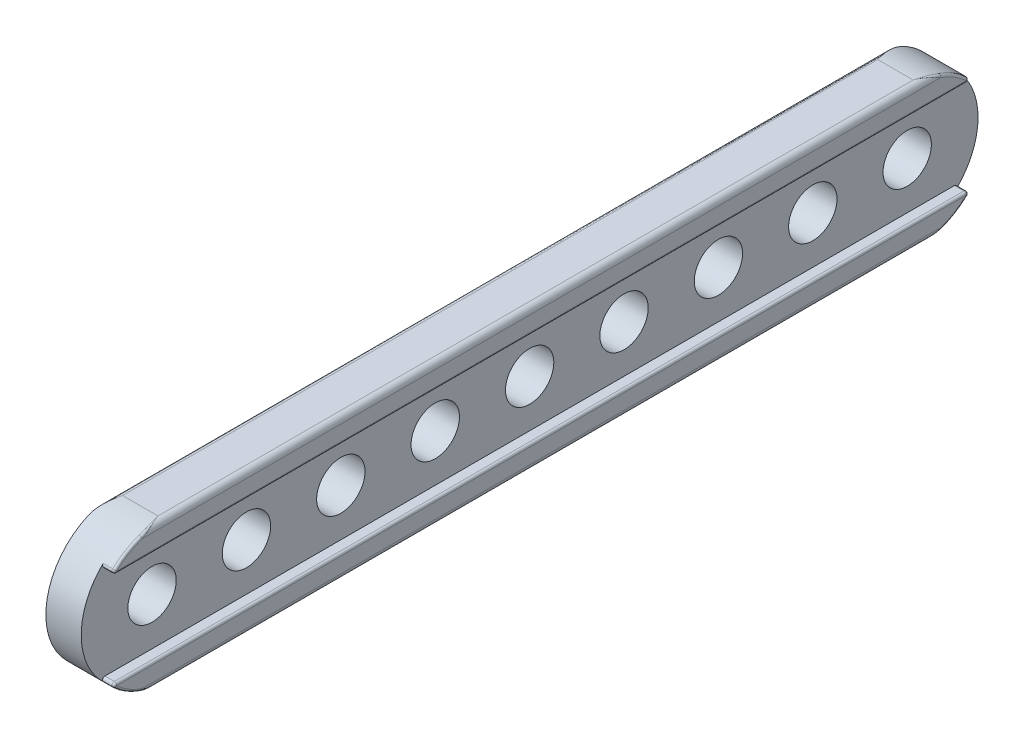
ISO-10303-21;
HEADER;
FILE_DESCRIPTION(('STEP AP214'),'2;1');
FILE_NAME('part.step','',(''),(''),'','','');
FILE_SCHEMA(('AUTOMOTIVE_DESIGN { 1 0 10303 214 1 1 1 1 }'));
ENDSEC;
DATA;
#1=APPLICATION_CONTEXT('core data for automotive mechanical design processes');
#2=APPLICATION_PROTOCOL_DEFINITION('international standard','automotive_design',2000,#1);
#3=PRODUCT_CONTEXT('',#1,'mechanical');
#4=PRODUCT('Part','Part','',(#3));
#5=PRODUCT_RELATED_PRODUCT_CATEGORY('part','',(#4));
#6=PRODUCT_DEFINITION_FORMATION('','',#4);
#7=PRODUCT_DEFINITION_CONTEXT('part definition',#1,'design');
#8=PRODUCT_DEFINITION('design','',#6,#7);
#9=PRODUCT_DEFINITION_SHAPE('','',#8);
#10=(LENGTH_UNIT() NAMED_UNIT(*) SI_UNIT(.MILLI.,.METRE.));
#11=(NAMED_UNIT(*) PLANE_ANGLE_UNIT() SI_UNIT($,.RADIAN.));
#12=(NAMED_UNIT(*) SI_UNIT($,.STERADIAN.) SOLID_ANGLE_UNIT());
#13=UNCERTAINTY_MEASURE_WITH_UNIT(LENGTH_MEASURE(1.E-05),#10,'distance_accuracy_value','');
#14=(GEOMETRIC_REPRESENTATION_CONTEXT(3) GLOBAL_UNCERTAINTY_ASSIGNED_CONTEXT((#13)) GLOBAL_UNIT_ASSIGNED_CONTEXT((#10,
#11,#12)) REPRESENTATION_CONTEXT('',''));
#15=CARTESIAN_POINT('',(0.,0.,0.));
#16=DIRECTION('',(0.,0.,1.));
#17=DIRECTION('',(1.,0.,0.));
#18=AXIS2_PLACEMENT_3D('',#15,#16,#17);
#19=CARTESIAN_POINT('',(1.8,4.2,-76.));
#20=DIRECTION('',(0.,0.,1.));
#21=DIRECTION('',(1.,0.,0.));
#22=AXIS2_PLACEMENT_3D('',#19,#20,#21);
#23=CYLINDRICAL_SURFACE('',#22,0.2);
#24=DIRECTION('',(0.,0.,-1.));
#25=VECTOR('',#24,1.);
#26=CARTESIAN_POINT('',(2.,4.2,-76.));
#27=LINE('',#26,#25);
#28=CARTESIAN_POINT('',(2.,4.2,-2.));
#29=VERTEX_POINT('',#28);
#30=CARTESIAN_POINT('',(2.,4.2,-74.));
#31=VERTEX_POINT('',#30);
#32=EDGE_CURVE('E387',#29,#31,#27,.T.);
#33=ORIENTED_EDGE('',*,*,#32,.F.);
#34=CARTESIAN_POINT('',(1.8,4.2,-2.));
#35=DIRECTION('',(0.,0.,-1.));
#36=DIRECTION('',(1.,0.,0.));
#37=AXIS2_PLACEMENT_3D('',#34,#35,#36);
#38=CIRCLE('',#37,0.2);
#39=CARTESIAN_POINT('',(1.8,4.,-2.));
#40=VERTEX_POINT('',#39);
#41=EDGE_CURVE('E395',#40,#29,#38,.F.);
#42=ORIENTED_EDGE('',*,*,#41,.F.);
#43=DIRECTION('',(0.,0.,-1.));
#44=VECTOR('',#43,1.);
#45=CARTESIAN_POINT('',(1.8,4.,-76.));
#46=LINE('',#45,#44);
#47=CARTESIAN_POINT('',(1.8,4.,-74.));
#48=VERTEX_POINT('',#47);
#49=EDGE_CURVE('E416',#48,#40,#46,.F.);
#50=ORIENTED_EDGE('',*,*,#49,.F.);
#51=CARTESIAN_POINT('',(1.8,4.2,-74.));
#52=DIRECTION('',(0.,0.,1.));
#53=DIRECTION('',(1.,0.,0.));
#54=AXIS2_PLACEMENT_3D('',#51,#52,#53);
#55=CIRCLE('',#54,0.2);
#56=EDGE_CURVE('E132',#48,#31,#55,.T.);
#57=ORIENTED_EDGE('',*,*,#56,.T.);
#58=EDGE_LOOP('',(#33,#42,#50,#57));
#59=FACE_BOUND('',#58,.T.);
#60=ADVANCED_FACE('F16',(#59),#23,.T.);
#61=CARTESIAN_POINT('',(1.8,-4.2,-76.));
#62=DIRECTION('',(0.,0.,1.));
#63=DIRECTION('',(1.,0.,0.));
#64=AXIS2_PLACEMENT_3D('',#61,#62,#63);
#65=CYLINDRICAL_SURFACE('',#64,0.2);
#66=DIRECTION('',(0.,0.,1.));
#67=VECTOR('',#66,1.);
#68=CARTESIAN_POINT('',(1.8,-4.,-76.));
#69=LINE('',#68,#67);
#70=CARTESIAN_POINT('',(1.8,-4.,-1.99999999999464));
#71=VERTEX_POINT('',#70);
#72=CARTESIAN_POINT('',(1.8,-4.,-74.));
#73=VERTEX_POINT('',#72);
#74=EDGE_CURVE('E419',#71,#73,#69,.F.);
#75=ORIENTED_EDGE('',*,*,#74,.F.);
#76=CARTESIAN_POINT('',(1.8,-4.2,-2.));
#77=DIRECTION('',(0.,-1.07327419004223E-10,1.));
#78=DIRECTION('',(1.,0.,0.));
#79=AXIS2_PLACEMENT_3D('',#76,#77,#78);
#80=CIRCLE('',#79,0.2);
#81=CARTESIAN_POINT('',(2.,-4.2,-2.));
#82=VERTEX_POINT('',#81);
#83=EDGE_CURVE('E735',#82,#71,#80,.T.);
#84=ORIENTED_EDGE('',*,*,#83,.F.);
#85=DIRECTION('',(0.,0.,1.));
#86=VECTOR('',#85,1.);
#87=CARTESIAN_POINT('',(2.,-4.2,-76.));
#88=LINE('',#87,#86);
#89=CARTESIAN_POINT('',(2.,-4.2,-74.));
#90=VERTEX_POINT('',#89);
#91=EDGE_CURVE('E745',#90,#82,#88,.T.);
#92=ORIENTED_EDGE('',*,*,#91,.F.);
#93=CARTESIAN_POINT('',(1.8,-4.2,-74.));
#94=DIRECTION('',(0.,0.,1.));
#95=DIRECTION('',(1.,0.,0.));
#96=AXIS2_PLACEMENT_3D('',#93,#94,#95);
#97=CIRCLE('',#96,0.2);
#98=EDGE_CURVE('E413',#73,#90,#97,.F.);
#99=ORIENTED_EDGE('',*,*,#98,.F.);
#100=EDGE_LOOP('',(#75,#84,#92,#99));
#101=FACE_BOUND('',#100,.T.);
#102=ADVANCED_FACE('F1112',(#101),#65,.T.);
#103=CARTESIAN_POINT('',(1.8,4.2,-74.));
#104=DIRECTION('',(1.,0.,0.));
#105=DIRECTION('',(0.,0.,-1.));
#106=AXIS2_PLACEMENT_3D('',#103,#104,#105);
#107=SPHERICAL_SURFACE('',#106,0.2);
#108=CARTESIAN_POINT('',(1.8,4.2,-74.));
#109=DIRECTION('',(1.,0.,0.));
#110=DIRECTION('',(0.,0.,-1.));
#111=AXIS2_PLACEMENT_3D('',#108,#109,#110);
#112=CIRCLE('',#111,0.200000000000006);
#113=CARTESIAN_POINT('',(1.8,4.3448275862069,-74.1379310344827));
#114=VERTEX_POINT('',#113);
#115=EDGE_CURVE('E491',#114,#48,#112,.F.);
#116=ORIENTED_EDGE('',*,*,#115,.F.);
#117=CARTESIAN_POINT('',(1.8,4.2,-74.));
#118=DIRECTION('',(0.,0.689655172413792,0.724137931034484));
#119=DIRECTION('',(0.,0.724137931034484,-0.689655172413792));
#120=AXIS2_PLACEMENT_3D('',#117,#118,#119);
#121=CIRCLE('',#120,0.2);
#122=EDGE_CURVE('E1216',#31,#114,#121,.T.);
#123=ORIENTED_EDGE('',*,*,#122,.F.);
#124=ORIENTED_EDGE('',*,*,#56,.F.);
#125=EDGE_LOOP('',(#116,#123,#124));
#126=FACE_BOUND('',#125,.T.);
#127=ADVANCED_FACE('F1104',(#126),#107,.T.);
#128=CARTESIAN_POINT('',(1.8,-4.2,-74.));
#129=DIRECTION('',(1.,0.,0.));
#130=DIRECTION('',(0.,0.,-1.));
#131=AXIS2_PLACEMENT_3D('',#128,#129,#130);
#132=SPHERICAL_SURFACE('',#131,0.2);
#133=CARTESIAN_POINT('',(1.8,-4.2,-74.));
#134=DIRECTION('',(1.,0.,0.));
#135=DIRECTION('',(0.,0.,-1.));
#136=AXIS2_PLACEMENT_3D('',#133,#134,#135);
#137=CIRCLE('',#136,0.200000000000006);
#138=CARTESIAN_POINT('',(1.8,-4.3448275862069,-74.1379310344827));
#139=VERTEX_POINT('',#138);
#140=EDGE_CURVE('E479',#73,#139,#137,.F.);
#141=ORIENTED_EDGE('',*,*,#140,.F.);
#142=ORIENTED_EDGE('',*,*,#98,.T.);
#143=CARTESIAN_POINT('',(1.8,-4.2,-74.));
#144=DIRECTION('',(0.,0.689655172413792,-0.724137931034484));
#145=DIRECTION('',(0.,-0.724137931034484,-0.689655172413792));
#146=AXIS2_PLACEMENT_3D('',#143,#144,#145);
#147=CIRCLE('',#146,0.2);
#148=EDGE_CURVE('E475',#139,#90,#147,.F.);
#149=ORIENTED_EDGE('',*,*,#148,.F.);
#150=EDGE_LOOP('',(#141,#142,#149));
#151=FACE_BOUND('',#150,.T.);
#152=ADVANCED_FACE('F1096',(#151),#132,.T.);
#153=CARTESIAN_POINT('',(1.8,4.2,-2.));
#154=DIRECTION('',(1.,0.,0.));
#155=DIRECTION('',(0.,0.,-1.));
#156=AXIS2_PLACEMENT_3D('',#153,#154,#155);
#157=SPHERICAL_SURFACE('',#156,0.2);
#158=CARTESIAN_POINT('',(1.8,4.2,-2.));
#159=DIRECTION('',(0.,-0.689655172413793,0.724137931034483));
#160=DIRECTION('',(0.,0.724137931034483,0.689655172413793));
#161=AXIS2_PLACEMENT_3D('',#158,#159,#160);
#162=CIRCLE('',#161,0.2);
#163=CARTESIAN_POINT('',(1.8,4.3448275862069,-1.86206896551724));
#164=VERTEX_POINT('',#163);
#165=EDGE_CURVE('E1199',#164,#29,#162,.F.);
#166=ORIENTED_EDGE('',*,*,#165,.F.);
#167=CARTESIAN_POINT('',(1.8,4.2,-2.));
#168=DIRECTION('',(1.,0.,0.));
#169=DIRECTION('',(0.,0.,-1.));
#170=AXIS2_PLACEMENT_3D('',#167,#168,#169);
#171=CIRCLE('',#170,0.2);
#172=EDGE_CURVE('E700',#40,#164,#171,.F.);
#173=ORIENTED_EDGE('',*,*,#172,.F.);
#174=ORIENTED_EDGE('',*,*,#41,.T.);
#175=EDGE_LOOP('',(#166,#173,#174));
#176=FACE_BOUND('',#175,.T.);
#177=ADVANCED_FACE('F378',(#176),#157,.T.);
#178=CARTESIAN_POINT('',(2.,5.49999999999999,-76.));
#179=DIRECTION('',(1.,0.,0.));
#180=DIRECTION('',(0.,0.,-1.));
#181=AXIS2_PLACEMENT_3D('',#178,#179,#180);
#182=PLANE('',#181);
#183=DIRECTION('',(0.,0.,1.));
#184=VECTOR('',#183,1.);
#185=CARTESIAN_POINT('',(2.,5.5,-76.));
#186=LINE('',#185,#184);
#187=CARTESIAN_POINT('',(2.,5.49999999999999,-4.15880473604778));
#188=VERTEX_POINT('',#187);
#189=CARTESIAN_POINT('',(2.,5.5,-71.8411952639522));
#190=VERTEX_POINT('',#189);
#191=EDGE_CURVE('E139',#188,#190,#186,.F.);
#192=ORIENTED_EDGE('',*,*,#191,.F.);
#193=CARTESIAN_POINT('',(2.,0.,-6.));
#194=DIRECTION('',(-1.,0.,0.));
#195=DIRECTION('',(0.,0.724137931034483,0.689655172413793));
#196=AXIS2_PLACEMENT_3D('',#193,#194,#195);
#197=CIRCLE('',#196,5.8);
#198=EDGE_CURVE('E402',#29,#188,#197,.T.);
#199=ORIENTED_EDGE('',*,*,#198,.F.);
#200=ORIENTED_EDGE('',*,*,#32,.T.);
#201=CARTESIAN_POINT('',(2.,0.,-70.));
#202=DIRECTION('',(-1.,0.,0.));
#203=DIRECTION('',(0.,0.948275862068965,-0.317447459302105));
#204=AXIS2_PLACEMENT_3D('',#201,#202,#203);
#205=CIRCLE('',#204,5.8);
#206=EDGE_CURVE('E359',#190,#31,#205,.T.);
#207=ORIENTED_EDGE('',*,*,#206,.F.);
#208=EDGE_LOOP('',(#192,#199,#200,#207));
#209=FACE_BOUND('',#208,.T.);
#210=ADVANCED_FACE('F367',(#209),#182,.T.);
#211=CARTESIAN_POINT('',(1.5,-5.5,-76.));
#212=DIRECTION('',(0.,0.,1.));
#213=DIRECTION('',(1.,0.,0.));
#214=AXIS2_PLACEMENT_3D('',#211,#212,#213);
#215=CYLINDRICAL_SURFACE('',#214,0.5);
#216=DIRECTION('',(0.,0.,1.));
#217=VECTOR('',#216,1.);
#218=CARTESIAN_POINT('',(2.,-5.5,-76.));
#219=LINE('',#218,#217);
#220=CARTESIAN_POINT('',(2.,-5.5,-4.1588047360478));
#221=VERTEX_POINT('',#220);
#222=CARTESIAN_POINT('',(2.,-5.50000000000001,-71.8411952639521));
#223=VERTEX_POINT('',#222);
#224=EDGE_CURVE('E394',#221,#223,#219,.F.);
#225=ORIENTED_EDGE('',*,*,#224,.F.);
#226=CARTESIAN_POINT('',(1.5,-6.,-6.));
#227=CARTESIAN_POINT('',(1.61742266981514,-6.,-5.69021310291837));
#228=CARTESIAN_POINT('',(1.73449625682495,-5.95910447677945,-5.38289179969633));
#229=CARTESIAN_POINT('',(1.87630782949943,-5.83516230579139,-4.9221843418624));
#230=CARTESIAN_POINT('',(1.91802838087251,-5.78309391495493,-4.7680893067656));
#231=CARTESIAN_POINT('',(1.97965458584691,-5.6575479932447,-4.46177941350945));
#232=CARTESIAN_POINT('',(2.,-5.58427330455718,-4.30984896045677));
#233=CARTESIAN_POINT('',(2.,-5.5,-4.1588047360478));
#234=(BOUNDED_CURVE() B_SPLINE_CURVE(3,(#226,#227,#228,#229,#230,#231,#232,#233),.UNSPECIFIED.,
.F.,.F.) B_SPLINE_CURVE_WITH_KNOTS((4,2,2,4),(0.,0.000951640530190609,0.00142746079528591,
0.00190328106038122),
.UNSPECIFIED.) CURVE() GEOMETRIC_REPRESENTATION_ITEM() RATIONAL_B_SPLINE_CURVE((1.,1.,1.,1.,1.,
0.999999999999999,0.999999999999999,0.999999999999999)) REPRESENTATION_ITEM(''));
#235=CARTESIAN_POINT('',(1.5,-6.,-6.));
#236=VERTEX_POINT('',#235);
#237=EDGE_CURVE('E179',#236,#221,#234,.T.);
#238=ORIENTED_EDGE('',*,*,#237,.F.);
#239=DIRECTION('',(0.,0.,-1.));
#240=VECTOR('',#239,1.);
#241=CARTESIAN_POINT('',(1.5,-6.,-76.));
#242=LINE('',#241,#240);
#243=CARTESIAN_POINT('',(1.5,-6.,-70.));
#244=VERTEX_POINT('',#243);
#245=EDGE_CURVE('E292',#244,#236,#242,.F.);
#246=ORIENTED_EDGE('',*,*,#245,.F.);
#247=CARTESIAN_POINT('',(2.,-5.50000000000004,-71.8411952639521));
#248=CARTESIAN_POINT('',(2.00000059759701,-5.51050167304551,-71.8223733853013));
#249=CARTESIAN_POINT('',(1.99968407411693,-5.52086645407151,-71.8034761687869));
#250=CARTESIAN_POINT('',(1.99845055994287,-5.54125262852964,-71.765652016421));
#251=CARTESIAN_POINT('',(1.99753691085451,-5.55127560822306,-71.7467258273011));
#252=CARTESIAN_POINT('',(1.9951477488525,-5.57097994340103,-71.7088428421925));
#253=CARTESIAN_POINT('',(1.99367484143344,-5.58066265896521,-71.6898865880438));
#254=CARTESIAN_POINT('',(1.99020706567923,-5.59968861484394,-71.6519427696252));
#255=CARTESIAN_POINT('',(1.98821418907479,-5.60903299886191,-71.6329555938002));
#256=CARTESIAN_POINT('',(1.98151821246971,-5.63652275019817,-71.5760215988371));
#257=CARTESIAN_POINT('',(1.97608673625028,-5.65421068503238,-71.5379370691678));
#258=CARTESIAN_POINT('',(1.96360686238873,-5.68824980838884,-71.4616311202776));
#259=CARTESIAN_POINT('',(1.95656502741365,-5.70460606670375,-71.4234108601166));
#260=CARTESIAN_POINT('',(1.94114224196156,-5.73598639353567,-71.3468410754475));
#261=CARTESIAN_POINT('',(1.93276557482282,-5.75101449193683,-71.3084923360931));
#262=CARTESIAN_POINT('',(1.91480429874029,-5.7797240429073,-71.2317255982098));
#263=CARTESIAN_POINT('',(1.90522373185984,-5.7934097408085,-71.1933082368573));
#264=CARTESIAN_POINT('',(1.8850333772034,-5.81943630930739,-71.1164487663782));
#265=CARTESIAN_POINT('',(1.87442729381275,-5.83178170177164,-71.0780072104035));
#266=CARTESIAN_POINT('',(1.85234869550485,-5.85512183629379,-71.0011449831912));
#267=CARTESIAN_POINT('',(1.84087981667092,-5.86612178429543,-70.9627248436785));
#268=CARTESIAN_POINT('',(1.81723653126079,-5.88679444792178,-70.8859037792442));
#269=CARTESIAN_POINT('',(1.80506475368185,-5.8964717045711,-70.8475032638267));
#270=CARTESIAN_POINT('',(1.78010369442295,-5.91452457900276,-70.7706880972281));
#271=CARTESIAN_POINT('',(1.76731571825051,-5.92290280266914,-70.7322736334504));
#272=CARTESIAN_POINT('',(1.74120768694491,-5.93835856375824,-70.6554215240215));
#273=CARTESIAN_POINT('',(1.72788833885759,-5.9454377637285,-70.616983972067));
#274=CARTESIAN_POINT('',(1.70080523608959,-5.95830059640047,-70.5400768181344));
#275=CARTESIAN_POINT('',(1.68704176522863,-5.96408503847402,-70.5016072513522));
#276=CARTESIAN_POINT('',(1.65915726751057,-5.97436222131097,-70.4246271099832));
#277=CARTESIAN_POINT('',(1.64503625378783,-5.97885500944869,-70.3861165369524));
#278=CARTESIAN_POINT('',(1.61652353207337,-5.98655300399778,-70.3090454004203));
#279=CARTESIAN_POINT('',(1.60213169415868,-5.98975757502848,-70.2704848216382));
#280=CARTESIAN_POINT('',(1.57316408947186,-5.99488293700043,-70.1933047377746));
#281=CARTESIAN_POINT('',(1.55858815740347,-5.99680247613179,-70.1546852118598));
#282=CARTESIAN_POINT('',(1.52933877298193,-5.99936210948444,-70.0773780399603));
#283=CARTESIAN_POINT('',(1.51466521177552,-6.00000038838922,-70.0386903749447));
#284=CARTESIAN_POINT('',(1.5,-6.,-70.));
#285=B_SPLINE_CURVE_WITH_KNOTS('',3,(#247,#248,#249,#250,#251,#252,#253,#254,#255,#256,#257,
#258,#259,#260,#261,#262,#263,#264,#265,#266,#267,#268,#269,#270,#271,#272,#273,#274,#275,#276,
#277,#278,#279,#280,#281,#282,#283,#284),.UNSPECIFIED.,.F.,.F.,(4,2,2,2,2,2,2,2,2,2,2,2,2,2,2,2,
2,2,4),(0.,0.06465587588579,0.128952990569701,0.192954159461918,0.256713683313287,
0.383673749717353,0.510125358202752,0.636179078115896,0.761820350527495,0.887023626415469,
1.01172600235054,1.13598888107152,1.25999916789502,1.38384961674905,1.50762242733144,
1.63139069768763,1.75521993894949,1.87916963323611,2.00329481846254),.UNSPECIFIED.);
#286=EDGE_CURVE('E428',#223,#244,#285,.T.);
#287=ORIENTED_EDGE('',*,*,#286,.F.);
#288=EDGE_LOOP('',(#225,#238,#246,#287));
#289=FACE_BOUND('',#288,.T.);
#290=ADVANCED_FACE('F377',(#289),#215,.T.);
#291=CARTESIAN_POINT('',(2.,-4.2,-76.));
#292=DIRECTION('',(1.,0.,0.));
#293=DIRECTION('',(0.,1.,0.));
#294=AXIS2_PLACEMENT_3D('',#291,#292,#293);
#295=PLANE('',#294);
#296=ORIENTED_EDGE('',*,*,#91,.T.);
#297=CARTESIAN_POINT('',(2.,0.,-6.));
#298=DIRECTION('',(-1.,0.,0.));
#299=DIRECTION('',(0.,-0.948275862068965,0.317447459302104));
#300=AXIS2_PLACEMENT_3D('',#297,#298,#299);
#301=CIRCLE('',#300,5.8);
#302=EDGE_CURVE('E184',#221,#82,#301,.T.);
#303=ORIENTED_EDGE('',*,*,#302,.F.);
#304=ORIENTED_EDGE('',*,*,#224,.T.);
#305=CARTESIAN_POINT('',(2.,0.,-70.));
#306=DIRECTION('',(-1.,0.,0.));
#307=DIRECTION('',(0.,-0.724137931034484,-0.689655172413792));
#308=AXIS2_PLACEMENT_3D('',#305,#306,#307);
#309=CIRCLE('',#308,5.8);
#310=EDGE_CURVE('E478',#90,#223,#309,.T.);
#311=ORIENTED_EDGE('',*,*,#310,.F.);
#312=EDGE_LOOP('',(#296,#303,#304,#311));
#313=FACE_BOUND('',#312,.T.);
#314=ADVANCED_FACE('F756',(#313),#295,.T.);
#315=CARTESIAN_POINT('',(1.8,-4.2,-2.));
#316=DIRECTION('',(1.,0.,0.));
#317=DIRECTION('',(0.,0.,-1.));
#318=AXIS2_PLACEMENT_3D('',#315,#316,#317);
#319=SPHERICAL_SURFACE('',#318,0.2);
#320=CARTESIAN_POINT('',(1.8,-4.2,-2.));
#321=DIRECTION('',(0.,-0.689655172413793,-0.724137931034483));
#322=DIRECTION('',(0.,-0.724137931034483,0.689655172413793));
#323=AXIS2_PLACEMENT_3D('',#320,#321,#322);
#324=CIRCLE('',#323,0.2);
#325=CARTESIAN_POINT('',(1.8,-4.3448275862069,-1.86206896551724));
#326=VERTEX_POINT('',#325);
#327=EDGE_CURVE('E185',#82,#326,#324,.T.);
#328=ORIENTED_EDGE('',*,*,#327,.F.);
#329=ORIENTED_EDGE('',*,*,#83,.T.);
#330=CARTESIAN_POINT('',(1.8,-4.2,-2.));
#331=DIRECTION('',(1.,0.,0.));
#332=DIRECTION('',(0.,0.,-1.));
#333=AXIS2_PLACEMENT_3D('',#330,#331,#332);
#334=CIRCLE('',#333,0.2);
#335=EDGE_CURVE('E100',#326,#71,#334,.F.);
#336=ORIENTED_EDGE('',*,*,#335,.F.);
#337=EDGE_LOOP('',(#328,#329,#336));
#338=FACE_BOUND('',#337,.T.);
#339=ADVANCED_FACE('F723',(#338),#319,.T.);
#340=CARTESIAN_POINT('',(1.5,5.5,-76.));
#341=DIRECTION('',(0.,0.,1.));
#342=DIRECTION('',(1.,0.,0.));
#343=AXIS2_PLACEMENT_3D('',#340,#341,#342);
#344=CYLINDRICAL_SURFACE('',#343,0.5);
#345=DIRECTION('',(0.,0.,1.));
#346=VECTOR('',#345,1.);
#347=CARTESIAN_POINT('',(1.5,6.,-76.));
#348=LINE('',#347,#346);
#349=CARTESIAN_POINT('',(1.5,6.,-6.));
#350=VERTEX_POINT('',#349);
#351=CARTESIAN_POINT('',(1.5,6.,-70.));
#352=VERTEX_POINT('',#351);
#353=EDGE_CURVE('E285',#350,#352,#348,.F.);
#354=ORIENTED_EDGE('',*,*,#353,.F.);
#355=CARTESIAN_POINT('',(2.,5.49999999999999,-4.15880473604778));
#356=CARTESIAN_POINT('',(2.00000059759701,5.51050167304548,-4.17762661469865));
#357=CARTESIAN_POINT('',(1.99968407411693,5.52086645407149,-4.19652383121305));
#358=CARTESIAN_POINT('',(1.99845055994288,5.54125262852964,-4.23434798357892));
#359=CARTESIAN_POINT('',(1.99753691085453,5.55127560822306,-4.2532741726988));
#360=CARTESIAN_POINT('',(1.99514774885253,5.57097994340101,-4.2911571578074));
#361=CARTESIAN_POINT('',(1.99367484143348,5.58066265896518,-4.31011341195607));
#362=CARTESIAN_POINT('',(1.99020706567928,5.59968861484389,-4.34805723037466));
#363=CARTESIAN_POINT('',(1.98821418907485,5.60903299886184,-4.36704440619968));
#364=CARTESIAN_POINT('',(1.98151821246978,5.63652275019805,-4.42397840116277));
#365=CARTESIAN_POINT('',(1.97608673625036,5.65421068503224,-4.46206293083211));
#366=CARTESIAN_POINT('',(1.96360686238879,5.68824980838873,-4.53836887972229));
#367=CARTESIAN_POINT('',(1.95656502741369,5.70460606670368,-4.57658913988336));
#368=CARTESIAN_POINT('',(1.94114224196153,5.73598639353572,-4.6531589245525));
#369=CARTESIAN_POINT('',(1.93276557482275,5.75101449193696,-4.69150766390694));
#370=CARTESIAN_POINT('',(1.91480429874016,5.7797240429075,-4.76827440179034));
#371=CARTESIAN_POINT('',(1.9052237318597,5.7934097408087,-4.80669176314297));
#372=CARTESIAN_POINT('',(1.88503337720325,5.81943630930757,-4.8835512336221));
#373=CARTESIAN_POINT('',(1.8744272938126,5.83178170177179,-4.92199278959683));
#374=CARTESIAN_POINT('',(1.85234869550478,5.85512183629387,-4.99885501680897));
#375=CARTESIAN_POINT('',(1.84087981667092,5.86612178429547,-5.03727515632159));
#376=CARTESIAN_POINT('',(1.8172365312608,5.88679444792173,-5.11409622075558));
#377=CARTESIAN_POINT('',(1.80506475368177,5.89647170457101,-5.15249673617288));
#378=CARTESIAN_POINT('',(1.78010369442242,5.9145245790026,-5.22931190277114));
#379=CARTESIAN_POINT('',(1.76731571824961,5.92290280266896,-5.26772636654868));
#380=CARTESIAN_POINT('',(1.7412076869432,5.93835856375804,-5.3445784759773));
#381=CARTESIAN_POINT('',(1.72788833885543,5.94543776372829,-5.38301602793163));
#382=CARTESIAN_POINT('',(1.70080523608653,5.95830059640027,-5.45992318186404));
#383=CARTESIAN_POINT('',(1.68704176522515,5.96408503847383,-5.49839274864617));
#384=CARTESIAN_POINT('',(1.65915726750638,5.97436222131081,-5.57537289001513));
#385=CARTESIAN_POINT('',(1.64503625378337,5.97885500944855,-5.61388346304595));
#386=CARTESIAN_POINT('',(1.61652353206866,5.98655300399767,-5.69095459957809));
#387=CARTESIAN_POINT('',(1.60213169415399,5.98975757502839,-5.7295151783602));
#388=CARTESIAN_POINT('',(1.57316408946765,5.99488293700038,-5.80669526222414));
#389=CARTESIAN_POINT('',(1.5585881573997,5.99680247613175,-5.8453147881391));
#390=CARTESIAN_POINT('',(1.5293387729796,5.99936210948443,-5.92262196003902));
#391=CARTESIAN_POINT('',(1.51466521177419,6.00000038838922,-5.96130962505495));
#392=CARTESIAN_POINT('',(1.5,6.,-6.));
#393=B_SPLINE_CURVE_WITH_KNOTS('',3,(#355,#356,#357,#358,#359,#360,#361,#362,#363,#364,#365,
#366,#367,#368,#369,#370,#371,#372,#373,#374,#375,#376,#377,#378,#379,#380,#381,#382,#383,#384,
#385,#386,#387,#388,#389,#390,#391,#392),.UNSPECIFIED.,.F.,.F.,(4,2,2,2,2,2,2,2,2,2,2,2,2,2,2,2,
2,2,4),(0.,0.0646558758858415,0.128952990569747,0.192954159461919,0.256713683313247,
0.383673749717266,0.510125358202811,0.636179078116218,0.761820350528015,0.887023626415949,
1.0117260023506,1.13598888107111,1.25999916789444,1.38384961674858,1.50762242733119,
1.63139069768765,1.75521993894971,1.87916963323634,2.00329481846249),.UNSPECIFIED.);
#394=EDGE_CURVE('E1198',#188,#350,#393,.T.);
#395=ORIENTED_EDGE('',*,*,#394,.F.);
#396=ORIENTED_EDGE('',*,*,#191,.T.);
#397=CARTESIAN_POINT('',(1.5,6.,-70.));
#398=CARTESIAN_POINT('',(1.5146652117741,6.00000038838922,-70.038690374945));
#399=CARTESIAN_POINT('',(1.52933877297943,5.99936210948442,-70.077378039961));
#400=CARTESIAN_POINT('',(1.55858815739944,5.99680247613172,-70.1546852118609));
#401=CARTESIAN_POINT('',(1.57316408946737,5.99488293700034,-70.1933047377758));
#402=CARTESIAN_POINT('',(1.60213169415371,5.98975757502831,-70.2704848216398));
#403=CARTESIAN_POINT('',(1.6165235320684,5.98655300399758,-70.3090454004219));
#404=CARTESIAN_POINT('',(1.64503625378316,5.97885500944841,-70.3861165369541));
#405=CARTESIAN_POINT('',(1.65915726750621,5.97436222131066,-70.424627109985));
#406=CARTESIAN_POINT('',(1.68704176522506,5.96408503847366,-70.501607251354));
#407=CARTESIAN_POINT('',(1.70080523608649,5.95830059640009,-70.5400768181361));
#408=CARTESIAN_POINT('',(1.72788833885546,5.9454377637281,-70.6169839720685));
#409=CARTESIAN_POINT('',(1.74120768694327,5.93835856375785,-70.6554215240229));
#410=CARTESIAN_POINT('',(1.76731571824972,5.92290280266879,-70.7322736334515));
#411=CARTESIAN_POINT('',(1.78010369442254,5.91452457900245,-70.770688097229));
#412=CARTESIAN_POINT('',(1.80506475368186,5.89647170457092,-70.8475032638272));
#413=CARTESIAN_POINT('',(1.81723653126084,5.88679444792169,-70.8859037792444));
#414=CARTESIAN_POINT('',(1.84087981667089,5.8661217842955,-70.9627248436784));
#415=CARTESIAN_POINT('',(1.85234869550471,5.85512183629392,-71.001144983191));
#416=CARTESIAN_POINT('',(1.87442729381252,5.83178170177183,-71.0780072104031));
#417=CARTESIAN_POINT('',(1.88503337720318,5.81943630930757,-71.1164487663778));
#418=CARTESIAN_POINT('',(1.90522373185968,5.79340974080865,-71.193308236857));
#419=CARTESIAN_POINT('',(1.91480429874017,5.77972404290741,-71.2317255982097));
#420=CARTESIAN_POINT('',(1.93276557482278,5.75101449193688,-71.3084923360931));
#421=CARTESIAN_POINT('',(1.94114224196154,5.73598639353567,-71.3468410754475));
#422=CARTESIAN_POINT('',(1.95656502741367,5.70460606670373,-71.4234108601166));
#423=CARTESIAN_POINT('',(1.96360686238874,5.68824980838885,-71.4616311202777));
#424=CARTESIAN_POINT('',(1.9760867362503,5.65421068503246,-71.5379370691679));
#425=CARTESIAN_POINT('',(1.98151821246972,5.63652275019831,-71.5760215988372));
#426=CARTESIAN_POINT('',(1.9882141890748,5.60903299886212,-71.6329555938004));
#427=CARTESIAN_POINT('',(1.99020706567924,5.59968861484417,-71.6519427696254));
#428=CARTESIAN_POINT('',(1.99367484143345,5.58066265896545,-71.6898865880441));
#429=CARTESIAN_POINT('',(1.99514774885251,5.57097994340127,-71.7088428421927));
#430=CARTESIAN_POINT('',(1.99753691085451,5.55127560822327,-71.7467258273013));
#431=CARTESIAN_POINT('',(1.99845055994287,5.54125262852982,-71.7656520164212));
#432=CARTESIAN_POINT('',(1.99968407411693,5.52086645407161,-71.803476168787));
#433=CARTESIAN_POINT('',(2.00000059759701,5.51050167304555,-71.8223733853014));
#434=CARTESIAN_POINT('',(2.,5.49999999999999,-71.8411952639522));
#435=B_SPLINE_CURVE_WITH_KNOTS('',3,(#397,#398,#399,#400,#401,#402,#403,#404,#405,#406,#407,
#408,#409,#410,#411,#412,#413,#414,#415,#416,#417,#418,#419,#420,#421,#422,#423,#424,#425,#426,
#427,#428,#429,#430,#431,#432,#433,#434),.UNSPECIFIED.,.F.,.F.,(4,2,2,2,2,2,2,2,2,2,2,2,2,2,2,2,
2,2,4),(0.,0.124125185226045,0.248074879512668,0.371904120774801,0.49567239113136,
0.619445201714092,0.74329565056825,0.867305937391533,0.991568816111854,1.11627119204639,
1.24147446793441,1.3671157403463,1.49316946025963,1.61962106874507,1.74658113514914,
1.81034065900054,1.87434182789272,1.93863894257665,2.00329481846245),.UNSPECIFIED.);
#436=EDGE_CURVE('E534',#352,#190,#435,.T.);
#437=ORIENTED_EDGE('',*,*,#436,.F.);
#438=EDGE_LOOP('',(#354,#395,#396,#437));
#439=FACE_BOUND('',#438,.T.);
#440=ADVANCED_FACE('F712',(#439),#344,.T.);
#441=CARTESIAN_POINT('',(1.,4.,-76.));
#442=DIRECTION('',(0.,-1.,0.));
#443=DIRECTION('',(0.,0.,-1.));
#444=AXIS2_PLACEMENT_3D('',#441,#442,#443);
#445=PLANE('',#444);
#446=ORIENTED_EDGE('',*,*,#49,.T.);
#447=DIRECTION('',(1.,0.,0.));
#448=VECTOR('',#447,1.);
#449=CARTESIAN_POINT('',(-2.,4.,-2.));
#450=LINE('',#449,#448);
#451=CARTESIAN_POINT('',(1.,4.,-2.));
#452=VERTEX_POINT('',#451);
#453=EDGE_CURVE('E471',#452,#40,#450,.T.);
#454=ORIENTED_EDGE('',*,*,#453,.F.);
#455=DIRECTION('',(0.,0.,-1.));
#456=VECTOR('',#455,1.);
#457=CARTESIAN_POINT('',(1.,4.,-76.));
#458=LINE('',#457,#456);
#459=CARTESIAN_POINT('',(1.,4.,-74.));
#460=VERTEX_POINT('',#459);
#461=EDGE_CURVE('E273',#460,#452,#458,.F.);
#462=ORIENTED_EDGE('',*,*,#461,.F.);
#463=DIRECTION('',(1.,0.,0.));
#464=VECTOR('',#463,1.);
#465=CARTESIAN_POINT('',(1.,4.,-74.));
#466=LINE('',#465,#464);
#467=EDGE_CURVE('E92',#460,#48,#466,.T.);
#468=ORIENTED_EDGE('',*,*,#467,.T.);
#469=EDGE_LOOP('',(#446,#454,#462,#468));
#470=FACE_BOUND('',#469,.T.);
#471=ADVANCED_FACE('F722',(#470),#445,.T.);
#472=CARTESIAN_POINT('',(1.,-4.,-76.));
#473=DIRECTION('',(0.,1.,0.));
#474=DIRECTION('',(0.,0.,1.));
#475=AXIS2_PLACEMENT_3D('',#472,#473,#474);
#476=PLANE('',#475);
#477=DIRECTION('',(0.,0.,-1.));
#478=VECTOR('',#477,1.);
#479=CARTESIAN_POINT('',(1.,-4.,-76.));
#480=LINE('',#479,#478);
#481=CARTESIAN_POINT('',(1.,-4.,-2.));
#482=VERTEX_POINT('',#481);
#483=CARTESIAN_POINT('',(1.,-4.,-74.));
#484=VERTEX_POINT('',#483);
#485=EDGE_CURVE('E660',#482,#484,#480,.T.);
#486=ORIENTED_EDGE('',*,*,#485,.F.);
#487=DIRECTION('',(1.,0.,0.));
#488=VECTOR('',#487,1.);
#489=CARTESIAN_POINT('',(-2.,-4.,-2.));
#490=LINE('',#489,#488);
#491=EDGE_CURVE('E286',#71,#482,#490,.F.);
#492=ORIENTED_EDGE('',*,*,#491,.F.);
#493=ORIENTED_EDGE('',*,*,#74,.T.);
#494=DIRECTION('',(1.,0.,0.));
#495=VECTOR('',#494,1.);
#496=CARTESIAN_POINT('',(-2.,-3.99999999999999,-74.));
#497=LINE('',#496,#495);
#498=EDGE_CURVE('E685',#484,#73,#497,.T.);
#499=ORIENTED_EDGE('',*,*,#498,.F.);
#500=EDGE_LOOP('',(#486,#492,#493,#499));
#501=FACE_BOUND('',#500,.T.);
#502=ADVANCED_FACE('F1047',(#501),#476,.T.);
#503=CARTESIAN_POINT('',(1.8,5.68965517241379,-71.9046847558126));
#504=CARTESIAN_POINT('',(2.,5.68965517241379,-71.9046847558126));
#505=CARTESIAN_POINT('',(2.,5.5,-71.8411952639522));
#506=CARTESIAN_POINT('',(1.79999997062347,5.74196399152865,-71.7484283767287));
#507=CARTESIAN_POINT('',(1.97045433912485,5.74114241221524,-71.7508825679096));
#508=CARTESIAN_POINT('',(2.,5.58427330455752,-71.6901510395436));
#509=CARTESIAN_POINT('',(1.78779274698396,5.78744357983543,-71.591262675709));
#510=CARTESIAN_POINT('',(1.93488812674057,5.78927007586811,-71.585590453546));
#511=CARTESIAN_POINT('',(1.97965458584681,5.65754799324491,-71.5382205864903));
#512=CARTESIAN_POINT('',(1.75081703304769,5.8653686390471,-71.2743903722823));
#513=CARTESIAN_POINT('',(1.85852858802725,5.86717759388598,-71.2654264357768));
#514=CARTESIAN_POINT('',(1.91802838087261,5.78309391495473,-71.2319106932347));
#515=CARTESIAN_POINT('',(1.72578469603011,5.89768694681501,-71.1149817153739));
#516=CARTESIAN_POINT('',(1.81686761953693,5.89985102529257,-71.1039493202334));
#517=CARTESIAN_POINT('',(1.87630782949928,5.83516230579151,-71.0778156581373));
#518=CARTESIAN_POINT('',(1.64069775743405,5.97461657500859,-70.6383877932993));
#519=CARTESIAN_POINT('',(1.69113578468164,5.97329674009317,-70.6421458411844));
#520=CARTESIAN_POINT('',(1.73449625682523,5.9591044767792,-70.6171082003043));
#521=CARTESIAN_POINT('',(1.57046733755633,6.,-70.3205316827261));
#522=CARTESIAN_POINT('',(1.59402437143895,5.99999999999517,-70.3154173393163));
#523=CARTESIAN_POINT('',(1.61742266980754,6.,-70.3097868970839));
#524=CARTESIAN_POINT('',(1.5,6.,-70.));
#525=CARTESIAN_POINT('',(1.5,6.,-70.));
#526=CARTESIAN_POINT('',(1.5,6.,-70.));
#527=(BOUNDED_SURFACE() B_SPLINE_SURFACE(3,2,((#503,#504,#505),(#506,#507,#508),(#509,#510,
#511),(#512,#513,#514),(#515,#516,#517),(#518,#519,#520),(#521,#522,#523),(#524,#525,#526)),
.UNSPECIFIED.,.F.,.F.,.F.) B_SPLINE_SURFACE_WITH_KNOTS((4,2,2,4),(3,3),(0.,0.000475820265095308,
0.000951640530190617,0.00190328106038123),(0.,1.),
.UNSPECIFIED.) GEOMETRIC_REPRESENTATION_ITEM() RATIONAL_B_SPLINE_SURFACE(((1.,0.707106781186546,
1.),(1.,0.763445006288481,1.),(1.,0.808035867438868,1.),(1.,0.881871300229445,1.),(1.,
0.910925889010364,1.),(1.,0.979039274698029,1.),(1.,0.999679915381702,1.),(1.,1.,1.))) REPRESENTATION_ITEM('') SURFACE());
#528=CARTESIAN_POINT('',(1.8,5.49999999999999,-71.8411952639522));
#529=DIRECTION('',(0.,0.317447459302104,0.948275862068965));
#530=DIRECTION('',(0.,0.948275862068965,-0.317447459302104));
#531=AXIS2_PLACEMENT_3D('',#528,#529,#530);
#532=CIRCLE('',#531,0.2);
#533=CARTESIAN_POINT('',(1.8,5.68965517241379,-71.9046847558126));
#534=VERTEX_POINT('',#533);
#535=EDGE_CURVE('E505',#534,#190,#532,.F.);
#536=CARTESIAN_POINT('',(1.8,5.68965517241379,-71.9046847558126));
#537=CARTESIAN_POINT('',(1.79999997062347,5.74196399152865,-71.7484283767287));
#538=CARTESIAN_POINT('',(1.78779274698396,5.78744357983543,-71.591262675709));
#539=CARTESIAN_POINT('',(1.75081703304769,5.8653686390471,-71.2743903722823));
#540=CARTESIAN_POINT('',(1.72578469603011,5.89768694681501,-71.1149817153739));
#541=CARTESIAN_POINT('',(1.64069775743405,5.97461657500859,-70.6383877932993));
#542=CARTESIAN_POINT('',(1.57046733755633,6.,-70.3205316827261));
#543=CARTESIAN_POINT('',(1.5,6.,-70.));
#544=(BOUNDED_CURVE() B_SPLINE_CURVE(3,(#536,#537,#538,#539,#540,#541,#542,#543),.UNSPECIFIED.,
.F.,.F.) B_SPLINE_CURVE_WITH_KNOTS((4,2,2,4),(0.,0.000475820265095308,0.000951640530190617,
0.00190328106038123),
.UNSPECIFIED.) CURVE() GEOMETRIC_REPRESENTATION_ITEM() RATIONAL_B_SPLINE_CURVE((1.,1.,1.,1.,1.,
1.,1.,1.)) REPRESENTATION_ITEM(''));
#545=EDGE_CURVE('E652',#352,#534,#544,.F.);
#546=ORIENTED_EDGE('',*,*,#436,.T.);
#547=ORIENTED_EDGE('',*,*,#535,.F.);
#548=ORIENTED_EDGE('',*,*,#545,.F.);
#549=EDGE_LOOP('',(#546,#547,#548));
#550=FACE_BOUND('',#549,.T.);
#551=ADVANCED_FACE('F514',(#550),#527,.T.);
#552=CARTESIAN_POINT('',(1.8,0.,-70.));
#553=DIRECTION('',(1.,0.,0.));
#554=DIRECTION('',(0.,0.,-1.));
#555=AXIS2_PLACEMENT_3D('',#552,#553,#554);
#556=TOROIDAL_SURFACE('',#555,5.8,0.2);
#557=ORIENTED_EDGE('',*,*,#535,.T.);
#558=ORIENTED_EDGE('',*,*,#206,.T.);
#559=ORIENTED_EDGE('',*,*,#122,.T.);
#560=CARTESIAN_POINT('',(1.8,0.,-70.));
#561=DIRECTION('',(1.,0.,0.));
#562=DIRECTION('',(0.,0.,-1.));
#563=AXIS2_PLACEMENT_3D('',#560,#561,#562);
#564=CIRCLE('',#563,6.00000000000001);
#565=EDGE_CURVE('E497',#534,#114,#564,.F.);
#566=ORIENTED_EDGE('',*,*,#565,.F.);
#567=EDGE_LOOP('',(#557,#558,#559,#566));
#568=FACE_BOUND('',#567,.T.);
#569=ADVANCED_FACE('F508',(#568),#556,.T.);
#570=CARTESIAN_POINT('',(-2.,4.2,-74.));
#571=DIRECTION('',(1.,0.,0.));
#572=DIRECTION('',(0.,0.,-1.));
#573=AXIS2_PLACEMENT_3D('',#570,#571,#572);
#574=CYLINDRICAL_SURFACE('',#573,0.200000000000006);
#575=DIRECTION('',(1.,0.,0.));
#576=VECTOR('',#575,1.);
#577=CARTESIAN_POINT('',(-2.,4.3448275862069,-74.1379310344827));
#578=LINE('',#577,#576);
#579=CARTESIAN_POINT('',(1.,4.3448275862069,-74.1379310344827));
#580=VERTEX_POINT('',#579);
#581=EDGE_CURVE('E494',#114,#580,#578,.F.);
#582=ORIENTED_EDGE('',*,*,#581,.F.);
#583=ORIENTED_EDGE('',*,*,#115,.T.);
#584=ORIENTED_EDGE('',*,*,#467,.F.);
#585=CARTESIAN_POINT('',(1.,4.2,-74.));
#586=DIRECTION('',(1.,0.,0.));
#587=DIRECTION('',(0.,0.,-1.));
#588=AXIS2_PLACEMENT_3D('',#585,#586,#587);
#589=CIRCLE('',#588,0.200000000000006);
#590=EDGE_CURVE('E305',#580,#460,#589,.F.);
#591=ORIENTED_EDGE('',*,*,#590,.F.);
#592=EDGE_LOOP('',(#582,#583,#584,#591));
#593=FACE_BOUND('',#592,.T.);
#594=ADVANCED_FACE('F513',(#593),#574,.T.);
#595=CARTESIAN_POINT('',(-2.,-4.2,-74.));
#596=DIRECTION('',(1.,0.,0.));
#597=DIRECTION('',(0.,0.,-1.));
#598=AXIS2_PLACEMENT_3D('',#595,#596,#597);
#599=CYLINDRICAL_SURFACE('',#598,0.200000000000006);
#600=ORIENTED_EDGE('',*,*,#140,.T.);
#601=DIRECTION('',(1.,0.,0.));
#602=VECTOR('',#601,1.);
#603=CARTESIAN_POINT('',(-2.,-4.3448275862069,-74.1379310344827));
#604=LINE('',#603,#602);
#605=CARTESIAN_POINT('',(1.,-4.3448275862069,-74.1379310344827));
#606=VERTEX_POINT('',#605);
#607=EDGE_CURVE('E482',#606,#139,#604,.T.);
#608=ORIENTED_EDGE('',*,*,#607,.F.);
#609=CARTESIAN_POINT('',(1.,-4.2,-74.));
#610=DIRECTION('',(1.,0.,0.));
#611=DIRECTION('',(0.,0.,-1.));
#612=AXIS2_PLACEMENT_3D('',#609,#610,#611);
#613=CIRCLE('',#612,0.200000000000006);
#614=EDGE_CURVE('E658',#484,#606,#613,.F.);
#615=ORIENTED_EDGE('',*,*,#614,.F.);
#616=ORIENTED_EDGE('',*,*,#498,.T.);
#617=EDGE_LOOP('',(#600,#608,#615,#616));
#618=FACE_BOUND('',#617,.T.);
#619=ADVANCED_FACE('F1021',(#618),#599,.T.);
#620=CARTESIAN_POINT('',(1.8,0.,-70.));
#621=DIRECTION('',(1.,0.,0.));
#622=DIRECTION('',(0.,1.,0.));
#623=AXIS2_PLACEMENT_3D('',#620,#621,#622);
#624=TOROIDAL_SURFACE('',#623,5.8,0.2);
#625=CARTESIAN_POINT('',(1.8,-5.50000000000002,-71.8411952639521));
#626=DIRECTION('',(0.,-0.317447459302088,0.948275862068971));
#627=DIRECTION('',(0.,-0.948275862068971,-0.317447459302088));
#628=AXIS2_PLACEMENT_3D('',#625,#626,#627);
#629=CIRCLE('',#628,0.199999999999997);
#630=CARTESIAN_POINT('',(1.80000009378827,-5.68965517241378,-71.9046847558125));
#631=VERTEX_POINT('',#630);
#632=EDGE_CURVE('E464',#631,#223,#629,.T.);
#633=ORIENTED_EDGE('',*,*,#632,.F.);
#634=CARTESIAN_POINT('',(1.8,0.,-70.));
#635=DIRECTION('',(1.,0.,0.));
#636=DIRECTION('',(0.,0.,-1.));
#637=AXIS2_PLACEMENT_3D('',#634,#635,#636);
#638=CIRCLE('',#637,6.00000000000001);
#639=EDGE_CURVE('E485',#139,#631,#638,.F.);
#640=ORIENTED_EDGE('',*,*,#639,.F.);
#641=ORIENTED_EDGE('',*,*,#148,.T.);
#642=ORIENTED_EDGE('',*,*,#310,.T.);
#643=EDGE_LOOP('',(#633,#640,#641,#642));
#644=FACE_BOUND('',#643,.T.);
#645=ADVANCED_FACE('F448',(#644),#624,.T.);
#646=CARTESIAN_POINT('',(2.,-5.50000000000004,-71.8411952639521));
#647=CARTESIAN_POINT('',(1.99999999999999,-5.68965517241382,-71.9046847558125));
#648=CARTESIAN_POINT('',(1.8,-5.68965517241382,-71.9046847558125));
#649=CARTESIAN_POINT('',(2.,-5.58427330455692,-71.6901510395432));
#650=CARTESIAN_POINT('',(1.97045433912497,-5.74114241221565,-71.7508825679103));
#651=CARTESIAN_POINT('',(1.79999997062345,-5.74196399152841,-71.7484283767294));
#652=CARTESIAN_POINT('',(1.97965458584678,-5.65754799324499,-71.5382205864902));
#653=CARTESIAN_POINT('',(1.93488812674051,-5.78927007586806,-71.5855904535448));
#654=CARTESIAN_POINT('',(1.78779274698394,-5.7874435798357,-71.5912626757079));
#655=CARTESIAN_POINT('',(1.91802838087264,-5.78309391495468,-71.2319106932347));
#656=CARTESIAN_POINT('',(1.85852858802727,-5.86717759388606,-71.2654264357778));
#657=CARTESIAN_POINT('',(1.7508170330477,-5.86536863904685,-71.2743903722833));
#658=CARTESIAN_POINT('',(1.87630782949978,-5.83516230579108,-71.0778156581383));
#659=CARTESIAN_POINT('',(1.81686761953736,-5.89985102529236,-71.1039493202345));
#660=CARTESIAN_POINT('',(1.7257846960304,-5.89768694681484,-71.1149817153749));
#661=CARTESIAN_POINT('',(1.73449625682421,-5.95910447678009,-70.6171082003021));
#662=CARTESIAN_POINT('',(1.6911357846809,-5.97329674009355,-70.6421458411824));
#663=CARTESIAN_POINT('',(1.64069775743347,-5.97461657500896,-70.6383877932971));
#664=CARTESIAN_POINT('',(1.61742266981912,-6.,-70.3097868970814));
#665=CARTESIAN_POINT('',(1.59402437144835,-6.00000000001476,-70.3154173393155));
#666=CARTESIAN_POINT('',(1.57046733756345,-6.,-70.3205316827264));
#667=CARTESIAN_POINT('',(1.5,-6.,-70.));
#668=CARTESIAN_POINT('',(1.5,-6.,-70.));
#669=CARTESIAN_POINT('',(1.5,-6.,-70.));
#670=(BOUNDED_SURFACE() B_SPLINE_SURFACE(3,2,((#646,#647,#648),(#649,#650,#651),(#652,#653,
#654),(#655,#656,#657),(#658,#659,#660),(#661,#662,#663),(#664,#665,#666),(#667,#668,#669)),
.UNSPECIFIED.,.F.,.F.,.F.) B_SPLINE_SURFACE_WITH_KNOTS((4,2,2,4),(3,3),(0.,0.000475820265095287,
0.000951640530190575,0.00190328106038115),(0.,1.),
.UNSPECIFIED.) GEOMETRIC_REPRESENTATION_ITEM() RATIONAL_B_SPLINE_SURFACE(((1.,0.707106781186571,
1.),(1.,0.763445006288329,1.),(1.,0.808035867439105,1.),(1.,0.881871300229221,1.),(1.,
0.910925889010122,1.),(1.,0.979039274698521,1.),(1.,0.999679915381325,1.),(1.,1.,1.))) REPRESENTATION_ITEM('') SURFACE());
#671=CARTESIAN_POINT('',(1.5,-6.,-70.));
#672=CARTESIAN_POINT('',(1.5704673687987,-6.,-70.3205316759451));
#673=CARTESIAN_POINT('',(1.64069782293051,-5.97461657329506,-70.6383877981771));
#674=CARTESIAN_POINT('',(1.72578480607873,-5.8976869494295,-71.1149817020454));
#675=CARTESIAN_POINT('',(1.75081715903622,-5.86536864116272,-71.2743903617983));
#676=CARTESIAN_POINT('',(1.78779290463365,-5.78744358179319,-71.5912626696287));
#677=CARTESIAN_POINT('',(1.80000014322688,-5.7419639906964,-71.7484283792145));
#678=CARTESIAN_POINT('',(1.80000018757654,-5.68965517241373,-71.9046847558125));
#679=(BOUNDED_CURVE() B_SPLINE_CURVE(3,(#671,#672,#673,#674,#675,#676,#677,#678),.UNSPECIFIED.,
.F.,.F.) B_SPLINE_CURVE_WITH_KNOTS((4,2,2,4),(0.,0.000951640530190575,0.00142746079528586,
0.00190328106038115),
.UNSPECIFIED.) CURVE() GEOMETRIC_REPRESENTATION_ITEM() RATIONAL_B_SPLINE_CURVE((1.,
0.999999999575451,0.999999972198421,0.99999988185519,0.999999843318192,0.999999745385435,
0.999999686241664,0.999999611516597)) REPRESENTATION_ITEM(''));
#680=EDGE_CURVE('E634',#631,#244,#679,.F.);
#681=ORIENTED_EDGE('',*,*,#680,.F.);
#682=ORIENTED_EDGE('',*,*,#632,.T.);
#683=ORIENTED_EDGE('',*,*,#286,.T.);
#684=EDGE_LOOP('',(#681,#682,#683));
#685=FACE_BOUND('',#684,.T.);
#686=ADVANCED_FACE('F436',(#685),#670,.T.);
#687=CARTESIAN_POINT('',(-2.,4.2,-2.));
#688=DIRECTION('',(1.,0.,0.));
#689=DIRECTION('',(0.,0.,-1.));
#690=AXIS2_PLACEMENT_3D('',#687,#688,#689);
#691=CYLINDRICAL_SURFACE('',#690,0.2);
#692=ORIENTED_EDGE('',*,*,#172,.T.);
#693=DIRECTION('',(1.,0.,0.));
#694=VECTOR('',#693,1.);
#695=CARTESIAN_POINT('',(-2.,4.34482758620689,-1.86206896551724));
#696=LINE('',#695,#694);
#697=CARTESIAN_POINT('',(1.,4.3448275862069,-1.86206896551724));
#698=VERTEX_POINT('',#697);
#699=EDGE_CURVE('E618',#698,#164,#696,.T.);
#700=ORIENTED_EDGE('',*,*,#699,.F.);
#701=CARTESIAN_POINT('',(1.,4.2,-2.));
#702=DIRECTION('',(1.,0.,0.));
#703=DIRECTION('',(0.,0.,-1.));
#704=AXIS2_PLACEMENT_3D('',#701,#702,#703);
#705=CIRCLE('',#704,0.2);
#706=EDGE_CURVE('E667',#452,#698,#705,.F.);
#707=ORIENTED_EDGE('',*,*,#706,.F.);
#708=ORIENTED_EDGE('',*,*,#453,.T.);
#709=EDGE_LOOP('',(#692,#700,#707,#708));
#710=FACE_BOUND('',#709,.T.);
#711=ADVANCED_FACE('F447',(#710),#691,.T.);
#712=CARTESIAN_POINT('',(1.8,0.,-6.));
#713=DIRECTION('',(1.,0.,0.));
#714=DIRECTION('',(0.,0.,-1.));
#715=AXIS2_PLACEMENT_3D('',#712,#713,#714);
#716=TOROIDAL_SURFACE('',#715,5.8,0.2);
#717=CARTESIAN_POINT('',(1.8,5.49999999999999,-4.15880473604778));
#718=DIRECTION('',(0.,0.317447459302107,-0.948275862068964));
#719=DIRECTION('',(0.,0.948275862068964,0.317447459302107));
#720=AXIS2_PLACEMENT_3D('',#717,#718,#719);
#721=CIRCLE('',#720,0.2);
#722=CARTESIAN_POINT('',(1.80000009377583,5.68965517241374,-4.09531524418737));
#723=VERTEX_POINT('',#722);
#724=EDGE_CURVE('E300',#723,#188,#721,.T.);
#725=ORIENTED_EDGE('',*,*,#724,.F.);
#726=CARTESIAN_POINT('',(1.8,0.,-6.));
#727=DIRECTION('',(1.,0.,0.));
#728=DIRECTION('',(0.,0.,-1.));
#729=AXIS2_PLACEMENT_3D('',#726,#727,#728);
#730=CIRCLE('',#729,6.);
#731=EDGE_CURVE('E616',#164,#723,#730,.F.);
#732=ORIENTED_EDGE('',*,*,#731,.F.);
#733=ORIENTED_EDGE('',*,*,#165,.T.);
#734=ORIENTED_EDGE('',*,*,#198,.T.);
#735=EDGE_LOOP('',(#725,#732,#733,#734));
#736=FACE_BOUND('',#735,.T.);
#737=ADVANCED_FACE('F333',(#736),#716,.T.);
#738=CARTESIAN_POINT('',(2.,5.49999999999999,-4.15880473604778));
#739=CARTESIAN_POINT('',(2.,5.68965517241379,-4.09531524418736));
#740=CARTESIAN_POINT('',(1.8,5.68965517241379,-4.09531524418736));
#741=CARTESIAN_POINT('',(2.,5.58427330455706,-4.3098489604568));
#742=CARTESIAN_POINT('',(1.97045433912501,5.74114241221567,-4.2491174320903));
#743=CARTESIAN_POINT('',(1.79999997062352,5.74196399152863,-4.25157162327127));
#744=CARTESIAN_POINT('',(1.97965458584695,5.65754799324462,-4.4617794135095));
#745=CARTESIAN_POINT('',(1.93488812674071,5.78927007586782,-4.4144095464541));
#746=CARTESIAN_POINT('',(1.78779274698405,5.78744357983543,-4.40873732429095));
#747=CARTESIAN_POINT('',(1.91802838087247,5.78309391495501,-4.76808930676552));
#748=CARTESIAN_POINT('',(1.85852858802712,5.86717759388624,-4.73457356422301));
#749=CARTESIAN_POINT('',(1.7508170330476,5.8653686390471,-4.72560962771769));
#750=CARTESIAN_POINT('',(1.87630782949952,5.8351623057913,-4.92218434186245));
#751=CARTESIAN_POINT('',(1.81686761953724,5.8998510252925,-4.89605067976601));
#752=CARTESIAN_POINT('',(1.72578469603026,5.89768694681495,-4.88501828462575));
#753=CARTESIAN_POINT('',(1.73449625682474,5.95910447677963,-5.38289179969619));
#754=CARTESIAN_POINT('',(1.6911357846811,5.97329674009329,-5.35785415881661));
#755=CARTESIAN_POINT('',(1.64069775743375,5.97461657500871,-5.36161220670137));
#756=CARTESIAN_POINT('',(1.61742266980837,6.,-5.69021310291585));
#757=CARTESIAN_POINT('',(1.59402437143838,6.00000000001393,-5.68458266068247));
#758=CARTESIAN_POINT('',(1.57046733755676,6.,-5.67946831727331));
#759=CARTESIAN_POINT('',(1.5,6.,-6.));
#760=CARTESIAN_POINT('',(1.5,6.,-6.));
#761=CARTESIAN_POINT('',(1.5,6.,-6.));
#762=(BOUNDED_SURFACE() B_SPLINE_SURFACE(3,2,((#738,#739,#740),(#741,#742,#743),(#744,#745,
#746),(#747,#748,#749),(#750,#751,#752),(#753,#754,#755),(#756,#757,#758),(#759,#760,#761)),
.UNSPECIFIED.,.F.,.F.,.F.) B_SPLINE_SURFACE_WITH_KNOTS((4,2,2,4),(3,3),(0.,0.00047582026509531,
0.000951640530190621,0.00190328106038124),(0.,1.),
.UNSPECIFIED.) GEOMETRIC_REPRESENTATION_ITEM() RATIONAL_B_SPLINE_SURFACE(((1.,0.707106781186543,
1.),(1.,0.763445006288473,1.),(1.,0.808035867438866,1.),(1.,0.881871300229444,1.),(1.,
0.910925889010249,1.),(1.,0.979039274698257,1.),(1.,0.999679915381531,1.),(1.,1.,1.))) REPRESENTATION_ITEM('') SURFACE());
#763=CARTESIAN_POINT('',(1.5,6.,-6.));
#764=CARTESIAN_POINT('',(1.57046736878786,6.,-5.67946832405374));
#765=CARTESIAN_POINT('',(1.64069782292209,5.97461657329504,-5.36161220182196));
#766=CARTESIAN_POINT('',(1.725784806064,5.89768694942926,-4.88501829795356));
#767=CARTESIAN_POINT('',(1.75081715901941,5.86536864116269,-4.72560963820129));
#768=CARTESIAN_POINT('',(1.78779290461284,5.78744358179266,-4.40873733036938));
#769=CARTESIAN_POINT('',(1.80000014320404,5.74196399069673,-4.25157162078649));
#770=CARTESIAN_POINT('',(1.80000018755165,5.6896551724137,-4.09531524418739));
#771=(BOUNDED_CURVE() B_SPLINE_CURVE(3,(#763,#764,#765,#766,#767,#768,#769,#770),.UNSPECIFIED.,
.F.,.F.) B_SPLINE_CURVE_WITH_KNOTS((4,2,2,4),(0.,0.000951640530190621,0.00142746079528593,
0.00190328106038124),
.UNSPECIFIED.) CURVE() GEOMETRIC_REPRESENTATION_ITEM() RATIONAL_B_SPLINE_CURVE((1.,
0.999999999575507,0.99999997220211,0.999999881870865,0.99999984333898,0.999999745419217,
0.999999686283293,0.999999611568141)) REPRESENTATION_ITEM(''));
#772=EDGE_CURVE('E314',#723,#350,#771,.F.);
#773=ORIENTED_EDGE('',*,*,#772,.F.);
#774=ORIENTED_EDGE('',*,*,#724,.T.);
#775=ORIENTED_EDGE('',*,*,#394,.T.);
#776=EDGE_LOOP('',(#773,#774,#775));
#777=FACE_BOUND('',#776,.T.);
#778=ADVANCED_FACE('F321',(#777),#762,.T.);
#779=CARTESIAN_POINT('',(-1.5,-6.,-76.));
#780=DIRECTION('',(0.,-1.,0.));
#781=DIRECTION('',(0.,0.,-1.));
#782=AXIS2_PLACEMENT_3D('',#779,#780,#781);
#783=PLANE('',#782);
#784=DIRECTION('',(1.,0.,0.));
#785=VECTOR('',#784,1.);
#786=CARTESIAN_POINT('',(-2.,-6.,-6.));
#787=LINE('',#786,#785);
#788=CARTESIAN_POINT('',(-1.5,-6.,-6.00000000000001));
#789=VERTEX_POINT('',#788);
#790=EDGE_CURVE('E199',#789,#236,#787,.T.);
#791=ORIENTED_EDGE('',*,*,#790,.F.);
#792=DIRECTION('',(0.,0.,1.));
#793=VECTOR('',#792,1.);
#794=CARTESIAN_POINT('',(-1.5,-6.,-76.));
#795=LINE('',#794,#793);
#796=CARTESIAN_POINT('',(-1.5,-6.,-70.));
#797=VERTEX_POINT('',#796);
#798=EDGE_CURVE('E627',#797,#789,#795,.T.);
#799=ORIENTED_EDGE('',*,*,#798,.F.);
#800=DIRECTION('',(1.,0.,0.));
#801=VECTOR('',#800,1.);
#802=CARTESIAN_POINT('',(-2.,-6.00000000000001,-70.));
#803=LINE('',#802,#801);
#804=EDGE_CURVE('E638',#244,#797,#803,.F.);
#805=ORIENTED_EDGE('',*,*,#804,.F.);
#806=ORIENTED_EDGE('',*,*,#245,.T.);
#807=EDGE_LOOP('',(#791,#799,#805,#806));
#808=FACE_BOUND('',#807,.T.);
#809=ADVANCED_FACE('F332',(#808),#783,.T.);
#810=CARTESIAN_POINT('',(1.8,-5.68965517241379,-4.09531524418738));
#811=CARTESIAN_POINT('',(2.,-5.68965517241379,-4.09531524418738));
#812=CARTESIAN_POINT('',(2.,-5.5,-4.1588047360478));
#813=CARTESIAN_POINT('',(1.79999997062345,-5.74196399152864,-4.25157162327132));
#814=CARTESIAN_POINT('',(1.9704543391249,-5.74114241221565,-4.24911743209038));
#815=CARTESIAN_POINT('',(2.,-5.58427330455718,-4.30984896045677));
#816=CARTESIAN_POINT('',(1.78779274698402,-5.78744357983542,-4.40873732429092));
#817=CARTESIAN_POINT('',(1.93488812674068,-5.78927007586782,-4.41440954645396));
#818=CARTESIAN_POINT('',(1.97965458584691,-5.6575479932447,-4.46177941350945));
#819=CARTESIAN_POINT('',(1.75081703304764,-5.86536863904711,-4.72560962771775));
#820=CARTESIAN_POINT('',(1.85852858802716,-5.86717759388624,-4.73457356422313));
#821=CARTESIAN_POINT('',(1.91802838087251,-5.78309391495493,-4.7680893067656));
#822=CARTESIAN_POINT('',(1.7257846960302,-5.89768694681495,-4.88501828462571));
#823=CARTESIAN_POINT('',(1.81686761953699,-5.89985102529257,-4.89605067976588));
#824=CARTESIAN_POINT('',(1.87630782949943,-5.83516230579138,-4.9221843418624));
#825=CARTESIAN_POINT('',(1.64069775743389,-5.97461657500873,-5.36161220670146));
#826=CARTESIAN_POINT('',(1.69113578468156,-5.97329674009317,-5.3578541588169));
#827=CARTESIAN_POINT('',(1.73449625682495,-5.95910447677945,-5.38289179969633));
#828=CARTESIAN_POINT('',(1.57046733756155,-6.,-5.67946831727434));
#829=CARTESIAN_POINT('',(1.59402437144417,-5.99999999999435,-5.68458266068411));
#830=CARTESIAN_POINT('',(1.61742266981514,-6.,-5.69021310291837));
#831=CARTESIAN_POINT('',(1.5,-6.,-6.));
#832=CARTESIAN_POINT('',(1.5,-6.,-6.));
#833=CARTESIAN_POINT('',(1.5,-6.,-6.));
#834=(BOUNDED_SURFACE() B_SPLINE_SURFACE(3,2,((#810,#811,#812),(#813,#814,#815),(#816,#817,
#818),(#819,#820,#821),(#822,#823,#824),(#825,#826,#827),(#828,#829,#830),(#831,#832,#833)),
.UNSPECIFIED.,.F.,.F.,.F.) B_SPLINE_SURFACE_WITH_KNOTS((4,2,2,4),(3,3),(0.,0.000475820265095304,
0.000951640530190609,0.00190328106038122),(0.,1.),
.UNSPECIFIED.) GEOMETRIC_REPRESENTATION_ITEM() RATIONAL_B_SPLINE_SURFACE(((1.,0.707106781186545,
1.),(1.,0.763445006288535,1.),(1.,0.808035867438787,1.),(1.,0.881871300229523,1.),(1.,
0.910925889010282,1.),(1.,0.979039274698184,1.),(1.,0.999679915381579,1.),(1.,1.,1.))) REPRESENTATION_ITEM('') SURFACE());
#835=CARTESIAN_POINT('',(1.8,-5.5,-4.1588047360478));
#836=DIRECTION('',(0.,-0.317447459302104,-0.948275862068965));
#837=DIRECTION('',(0.,-0.948275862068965,0.317447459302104));
#838=AXIS2_PLACEMENT_3D('',#835,#836,#837);
#839=CIRCLE('',#838,0.2);
#840=CARTESIAN_POINT('',(1.8,-5.68965517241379,-4.09531524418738));
#841=VERTEX_POINT('',#840);
#842=EDGE_CURVE('E172',#841,#221,#839,.F.);
#843=CARTESIAN_POINT('',(1.8,-5.68965517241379,-4.09531524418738));
#844=CARTESIAN_POINT('',(1.79999997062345,-5.74196399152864,-4.25157162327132));
#845=CARTESIAN_POINT('',(1.78779274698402,-5.78744357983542,-4.40873732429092));
#846=CARTESIAN_POINT('',(1.75081703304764,-5.86536863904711,-4.72560962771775));
#847=CARTESIAN_POINT('',(1.7257846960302,-5.89768694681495,-4.88501828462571));
#848=CARTESIAN_POINT('',(1.64069775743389,-5.97461657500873,-5.36161220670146));
#849=CARTESIAN_POINT('',(1.57046733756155,-6.,-5.67946831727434));
#850=CARTESIAN_POINT('',(1.5,-6.,-6.));
#851=(BOUNDED_CURVE() B_SPLINE_CURVE(3,(#843,#844,#845,#846,#847,#848,#849,#850),.UNSPECIFIED.,
.F.,.F.) B_SPLINE_CURVE_WITH_KNOTS((4,2,2,4),(0.,0.000475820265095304,0.000951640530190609,
0.00190328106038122),
.UNSPECIFIED.) CURVE() GEOMETRIC_REPRESENTATION_ITEM() RATIONAL_B_SPLINE_CURVE((1.,1.,1.,1.,1.,
1.,1.,1.)) REPRESENTATION_ITEM(''));
#852=EDGE_CURVE('E176',#236,#841,#851,.F.);
#853=ORIENTED_EDGE('',*,*,#237,.T.);
#854=ORIENTED_EDGE('',*,*,#842,.F.);
#855=ORIENTED_EDGE('',*,*,#852,.F.);
#856=EDGE_LOOP('',(#853,#854,#855));
#857=FACE_BOUND('',#856,.T.);
#858=ADVANCED_FACE('F174',(#857),#834,.T.);
#859=CARTESIAN_POINT('',(1.8,0.,-6.));
#860=DIRECTION('',(1.,0.,0.));
#861=DIRECTION('',(0.,1.,0.));
#862=AXIS2_PLACEMENT_3D('',#859,#860,#861);
#863=TOROIDAL_SURFACE('',#862,5.8,0.2);
#864=ORIENTED_EDGE('',*,*,#842,.T.);
#865=ORIENTED_EDGE('',*,*,#302,.T.);
#866=ORIENTED_EDGE('',*,*,#327,.T.);
#867=CARTESIAN_POINT('',(1.8,0.,-6.));
#868=DIRECTION('',(1.,0.,0.));
#869=DIRECTION('',(0.,0.,-1.));
#870=AXIS2_PLACEMENT_3D('',#867,#868,#869);
#871=CIRCLE('',#870,6.);
#872=EDGE_CURVE('E189',#841,#326,#871,.F.);
#873=ORIENTED_EDGE('',*,*,#872,.F.);
#874=EDGE_LOOP('',(#864,#865,#866,#873));
#875=FACE_BOUND('',#874,.T.);
#876=ADVANCED_FACE('F190',(#875),#863,.T.);
#877=CARTESIAN_POINT('',(-2.,-4.2,-2.));
#878=DIRECTION('',(1.,0.,0.));
#879=DIRECTION('',(0.,0.,-1.));
#880=AXIS2_PLACEMENT_3D('',#877,#878,#879);
#881=CYLINDRICAL_SURFACE('',#880,0.2);
#882=DIRECTION('',(1.,0.,0.));
#883=VECTOR('',#882,1.);
#884=CARTESIAN_POINT('',(-2.,-4.3448275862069,-1.86206896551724));
#885=LINE('',#884,#883);
#886=CARTESIAN_POINT('',(1.,-4.3448275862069,-1.86206896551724));
#887=VERTEX_POINT('',#886);
#888=EDGE_CURVE('E193',#326,#887,#885,.F.);
#889=ORIENTED_EDGE('',*,*,#888,.F.);
#890=ORIENTED_EDGE('',*,*,#335,.T.);
#891=ORIENTED_EDGE('',*,*,#491,.T.);
#892=CARTESIAN_POINT('',(1.,-4.2,-2.));
#893=DIRECTION('',(1.,0.,0.));
#894=DIRECTION('',(0.,0.,-1.));
#895=AXIS2_PLACEMENT_3D('',#892,#893,#894);
#896=CIRCLE('',#895,0.2);
#897=EDGE_CURVE('E662',#887,#482,#896,.F.);
#898=ORIENTED_EDGE('',*,*,#897,.F.);
#899=EDGE_LOOP('',(#889,#890,#891,#898));
#900=FACE_BOUND('',#899,.T.);
#901=ADVANCED_FACE('F258',(#900),#881,.T.);
#902=CARTESIAN_POINT('',(-1.5,6.,-76.));
#903=DIRECTION('',(0.,1.,0.));
#904=DIRECTION('',(0.,0.,1.));
#905=AXIS2_PLACEMENT_3D('',#902,#903,#904);
#906=PLANE('',#905);
#907=DIRECTION('',(0.,0.,1.));
#908=VECTOR('',#907,1.);
#909=CARTESIAN_POINT('',(-1.5,6.,-76.));
#910=LINE('',#909,#908);
#911=CARTESIAN_POINT('',(-1.5,6.,-6.));
#912=VERTEX_POINT('',#911);
#913=CARTESIAN_POINT('',(-1.5,6.,-70.));
#914=VERTEX_POINT('',#913);
#915=EDGE_CURVE('E233',#912,#914,#910,.F.);
#916=ORIENTED_EDGE('',*,*,#915,.F.);
#917=DIRECTION('',(1.,0.,0.));
#918=VECTOR('',#917,1.);
#919=CARTESIAN_POINT('',(-2.,6.,-6.));
#920=LINE('',#919,#918);
#921=EDGE_CURVE('E613',#350,#912,#920,.F.);
#922=ORIENTED_EDGE('',*,*,#921,.F.);
#923=ORIENTED_EDGE('',*,*,#353,.T.);
#924=DIRECTION('',(1.,0.,0.));
#925=VECTOR('',#924,1.);
#926=CARTESIAN_POINT('',(-2.,6.00000000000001,-70.));
#927=LINE('',#926,#925);
#928=EDGE_CURVE('E655',#914,#352,#927,.T.);
#929=ORIENTED_EDGE('',*,*,#928,.F.);
#930=EDGE_LOOP('',(#916,#922,#923,#929));
#931=FACE_BOUND('',#930,.T.);
#932=ADVANCED_FACE('F254',(#931),#906,.T.);
#933=CARTESIAN_POINT('',(1.,-4.,-76.));
#934=DIRECTION('',(1.,0.,0.));
#935=DIRECTION('',(0.,0.,-1.));
#936=AXIS2_PLACEMENT_3D('',#933,#934,#935);
#937=PLANE('',#936);
#938=CARTESIAN_POINT('',(1.,0.,-70.));
#939=DIRECTION('',(1.,0.,0.));
#940=DIRECTION('',(0.,0.,-1.));
#941=AXIS2_PLACEMENT_3D('',#938,#939,#940);
#942=CIRCLE('',#941,2.05);
#943=CARTESIAN_POINT('',(1.,0.,-72.05));
#944=VERTEX_POINT('',#943);
#945=EDGE_CURVE('E579',#944,#944,#942,.F.);
#946=ORIENTED_EDGE('',*,*,#945,.T.);
#947=EDGE_LOOP('',(#946));
#948=FACE_BOUND('',#947,.T.);
#949=CARTESIAN_POINT('',(1.,0.,-62.));
#950=DIRECTION('',(1.,0.,0.));
#951=DIRECTION('',(0.,0.,-1.));
#952=AXIS2_PLACEMENT_3D('',#949,#950,#951);
#953=CIRCLE('',#952,2.05);
#954=CARTESIAN_POINT('',(1.,0.,-64.05));
#955=VERTEX_POINT('',#954);
#956=EDGE_CURVE('E582',#955,#955,#953,.F.);
#957=ORIENTED_EDGE('',*,*,#956,.T.);
#958=EDGE_LOOP('',(#957));
#959=FACE_BOUND('',#958,.T.);
#960=CARTESIAN_POINT('',(1.,0.,-54.));
#961=DIRECTION('',(1.,0.,0.));
#962=DIRECTION('',(0.,0.,-1.));
#963=AXIS2_PLACEMENT_3D('',#960,#961,#962);
#964=CIRCLE('',#963,2.05);
#965=CARTESIAN_POINT('',(1.,0.,-56.05));
#966=VERTEX_POINT('',#965);
#967=EDGE_CURVE('E585',#966,#966,#964,.F.);
#968=ORIENTED_EDGE('',*,*,#967,.T.);
#969=EDGE_LOOP('',(#968));
#970=FACE_BOUND('',#969,.T.);
#971=CARTESIAN_POINT('',(1.,0.,-46.));
#972=DIRECTION('',(1.,0.,0.));
#973=DIRECTION('',(0.,0.,-1.));
#974=AXIS2_PLACEMENT_3D('',#971,#972,#973);
#975=CIRCLE('',#974,2.05);
#976=CARTESIAN_POINT('',(1.,0.,-48.05));
#977=VERTEX_POINT('',#976);
#978=EDGE_CURVE('E588',#977,#977,#975,.F.);
#979=ORIENTED_EDGE('',*,*,#978,.T.);
#980=EDGE_LOOP('',(#979));
#981=FACE_BOUND('',#980,.T.);
#982=CARTESIAN_POINT('',(1.,0.,-38.));
#983=DIRECTION('',(1.,0.,0.));
#984=DIRECTION('',(0.,0.,-1.));
#985=AXIS2_PLACEMENT_3D('',#982,#983,#984);
#986=CIRCLE('',#985,2.05);
#987=CARTESIAN_POINT('',(1.,0.,-40.05));
#988=VERTEX_POINT('',#987);
#989=EDGE_CURVE('E591',#988,#988,#986,.F.);
#990=ORIENTED_EDGE('',*,*,#989,.T.);
#991=EDGE_LOOP('',(#990));
#992=FACE_BOUND('',#991,.T.);
#993=CARTESIAN_POINT('',(1.,0.,-30.));
#994=DIRECTION('',(1.,0.,0.));
#995=DIRECTION('',(0.,0.,-1.));
#996=AXIS2_PLACEMENT_3D('',#993,#994,#995);
#997=CIRCLE('',#996,2.05);
#998=CARTESIAN_POINT('',(1.,0.,-32.05));
#999=VERTEX_POINT('',#998);
#1000=EDGE_CURVE('E594',#999,#999,#997,.F.);
#1001=ORIENTED_EDGE('',*,*,#1000,.T.);
#1002=EDGE_LOOP('',(#1001));
#1003=FACE_BOUND('',#1002,.T.);
#1004=CARTESIAN_POINT('',(1.,0.,-22.));
#1005=DIRECTION('',(1.,0.,0.));
#1006=DIRECTION('',(0.,0.,-1.));
#1007=AXIS2_PLACEMENT_3D('',#1004,#1005,#1006);
#1008=CIRCLE('',#1007,2.05);
#1009=CARTESIAN_POINT('',(1.,0.,-24.05));
#1010=VERTEX_POINT('',#1009);
#1011=EDGE_CURVE('E597',#1010,#1010,#1008,.F.);
#1012=ORIENTED_EDGE('',*,*,#1011,.T.);
#1013=EDGE_LOOP('',(#1012));
#1014=FACE_BOUND('',#1013,.T.);
#1015=CARTESIAN_POINT('',(1.,0.,-6.));
#1016=DIRECTION('',(1.,0.,0.));
#1017=DIRECTION('',(0.,0.,-1.));
#1018=AXIS2_PLACEMENT_3D('',#1015,#1016,#1017);
#1019=CIRCLE('',#1018,2.05);
#1020=CARTESIAN_POINT('',(1.,0.,-8.05));
#1021=VERTEX_POINT('',#1020);
#1022=EDGE_CURVE('E599',#1021,#1021,#1019,.F.);
#1023=ORIENTED_EDGE('',*,*,#1022,.T.);
#1024=EDGE_LOOP('',(#1023));
#1025=FACE_BOUND('',#1024,.T.);
#1026=CARTESIAN_POINT('',(1.,0.,-14.));
#1027=DIRECTION('',(1.,0.,0.));
#1028=DIRECTION('',(0.,0.,-1.));
#1029=AXIS2_PLACEMENT_3D('',#1026,#1027,#1028);
#1030=CIRCLE('',#1029,2.05);
#1031=CARTESIAN_POINT('',(1.,0.,-16.05));
#1032=VERTEX_POINT('',#1031);
#1033=EDGE_CURVE('E235',#1032,#1032,#1030,.F.);
#1034=ORIENTED_EDGE('',*,*,#1033,.T.);
#1035=EDGE_LOOP('',(#1034));
#1036=FACE_BOUND('',#1035,.T.);
#1037=ORIENTED_EDGE('',*,*,#614,.T.);
#1038=CARTESIAN_POINT('',(1.,0.,-70.));
#1039=DIRECTION('',(1.,0.,0.));
#1040=DIRECTION('',(0.,0.,-1.));
#1041=AXIS2_PLACEMENT_3D('',#1038,#1039,#1040);
#1042=CIRCLE('',#1041,6.00000000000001);
#1043=EDGE_CURVE('E486',#580,#606,#1042,.F.);
#1044=ORIENTED_EDGE('',*,*,#1043,.F.);
#1045=ORIENTED_EDGE('',*,*,#590,.T.);
#1046=ORIENTED_EDGE('',*,*,#461,.T.);
#1047=ORIENTED_EDGE('',*,*,#706,.T.);
#1048=CARTESIAN_POINT('',(1.,0.,-6.));
#1049=DIRECTION('',(1.,0.,0.));
#1050=DIRECTION('',(0.,0.,-1.));
#1051=AXIS2_PLACEMENT_3D('',#1048,#1049,#1050);
#1052=CIRCLE('',#1051,6.);
#1053=EDGE_CURVE('E620',#887,#698,#1052,.F.);
#1054=ORIENTED_EDGE('',*,*,#1053,.F.);
#1055=ORIENTED_EDGE('',*,*,#897,.T.);
#1056=ORIENTED_EDGE('',*,*,#485,.T.);
#1057=EDGE_LOOP('',(#1037,#1044,#1045,#1046,#1047,#1054,#1055,#1056));
#1058=FACE_BOUND('',#1057,.T.);
#1059=ADVANCED_FACE('F251',(#948,#959,#970,#981,#992,#1003,#1014,#1025,#1036,#1058),#937,.T.);
#1060=CARTESIAN_POINT('',(-2.,0.,-70.));
#1061=DIRECTION('',(1.,0.,0.));
#1062=DIRECTION('',(0.,0.,-1.));
#1063=AXIS2_PLACEMENT_3D('',#1060,#1061,#1062);
#1064=CYLINDRICAL_SURFACE('',#1063,6.00000000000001);
#1065=ORIENTED_EDGE('',*,*,#804,.T.);
#1066=CARTESIAN_POINT('',(-2.,-5.50000000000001,-72.3979157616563));
#1067=CARTESIAN_POINT('',(-1.99999389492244,-5.51692516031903,-72.3590964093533));
#1068=CARTESIAN_POINT('',(-1.99914142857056,-5.53343410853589,-72.3201073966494));
#1069=CARTESIAN_POINT('',(-1.99594281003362,-5.5655979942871,-72.2418534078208));
#1070=CARTESIAN_POINT('',(-1.99359715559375,-5.58125321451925,-72.2025885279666));
#1071=CARTESIAN_POINT('',(-1.984627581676,-5.62687275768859,-72.084564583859));
#1072=CARTESIAN_POINT('',(-1.97606972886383,-5.65554626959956,-72.0054492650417));
#1073=CARTESIAN_POINT('',(-1.95499552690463,-5.70930644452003,-71.8468387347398));
#1074=CARTESIAN_POINT('',(-1.94249171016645,-5.73440410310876,-71.7673455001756));
#1075=CARTESIAN_POINT('',(-1.91436584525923,-5.78114912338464,-71.6078632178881));
#1076=CARTESIAN_POINT('',(-1.8987421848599,-5.80279469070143,-71.527873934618));
#1077=CARTESIAN_POINT('',(-1.85700367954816,-5.85218992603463,-71.3292037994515));
#1078=CARTESIAN_POINT('',(-1.82944515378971,-5.87790726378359,-71.2103161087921));
#1079=CARTESIAN_POINT('',(-1.77071059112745,-5.92197590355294,-70.9720581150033));
#1080=CARTESIAN_POINT('',(-1.73953261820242,-5.94032323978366,-70.8526875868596));
#1081=CARTESIAN_POINT('',(-1.6426004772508,-5.98446587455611,-70.4941158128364));
#1082=CARTESIAN_POINT('',(-1.57342350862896,-5.99938768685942,-70.2543491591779));
#1083=CARTESIAN_POINT('',(-1.50286440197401,-5.99999384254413,-70.0099226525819));
#1084=CARTESIAN_POINT('',(-1.50143216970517,-5.99999999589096,-70.0049612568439));
#1085=CARTESIAN_POINT('',(-1.5,-6.,-70.));
#1086=B_SPLINE_CURVE_WITH_KNOTS('',3,(#1066,#1067,#1068,#1069,#1070,#1071,#1072,#1073,#1074,
#1075,#1076,#1077,#1078,#1079,#1080,#1081,#1082,#1083,#1084,#1085),.UNSPECIFIED.,.F.,.F.,(4,2,2,
2,2,2,2,2,2,4),(0.,0.127017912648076,0.253993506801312,0.507530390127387,0.760270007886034,
1.01314057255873,1.38695992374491,1.76098015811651,2.50868937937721,2.52418132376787),.UNSPECIFIED.);
#1087=CARTESIAN_POINT('',(-2.,-5.5,-72.3979157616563));
#1088=VERTEX_POINT('',#1087);
#1089=EDGE_CURVE('E629',#1088,#797,#1086,.T.);
#1090=ORIENTED_EDGE('',*,*,#1089,.F.);
#1091=CARTESIAN_POINT('',(-2.,0.,-70.));
#1092=DIRECTION('',(1.,0.,0.));
#1093=DIRECTION('',(0.,0.,-1.));
#1094=AXIS2_PLACEMENT_3D('',#1091,#1092,#1093);
#1095=CIRCLE('',#1094,6.00000000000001);
#1096=CARTESIAN_POINT('',(-2.,5.5,-72.3979157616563));
#1097=VERTEX_POINT('',#1096);
#1098=EDGE_CURVE('E577',#1097,#1088,#1095,.F.);
#1099=ORIENTED_EDGE('',*,*,#1098,.F.);
#1100=CARTESIAN_POINT('',(-2.,5.50000000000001,-72.3979157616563));
#1101=CARTESIAN_POINT('',(-1.99999389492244,5.51692516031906,-72.3590964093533));
#1102=CARTESIAN_POINT('',(-1.99914142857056,5.53343410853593,-72.3201073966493));
#1103=CARTESIAN_POINT('',(-1.99594281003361,5.56559799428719,-72.2418534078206));
#1104=CARTESIAN_POINT('',(-1.99359715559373,5.58125321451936,-72.2025885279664));
#1105=CARTESIAN_POINT('',(-1.98462758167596,5.62687275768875,-72.0845645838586));
#1106=CARTESIAN_POINT('',(-1.97606972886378,5.65554626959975,-72.0054492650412));
#1107=CARTESIAN_POINT('',(-1.95499552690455,5.7093064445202,-71.8468387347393));
#1108=CARTESIAN_POINT('',(-1.94249171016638,5.73440410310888,-71.7673455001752));
#1109=CARTESIAN_POINT('',(-1.91436584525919,5.78114912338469,-71.6078632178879));
#1110=CARTESIAN_POINT('',(-1.89874218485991,5.80279469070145,-71.5278739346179));
#1111=CARTESIAN_POINT('',(-1.85700367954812,5.85218992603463,-71.3292037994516));
#1112=CARTESIAN_POINT('',(-1.82944515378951,5.87790726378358,-71.2103161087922));
#1113=CARTESIAN_POINT('',(-1.77071059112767,5.92197590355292,-70.9720581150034));
#1114=CARTESIAN_POINT('',(-1.73953261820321,5.94032323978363,-70.8526875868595));
#1115=CARTESIAN_POINT('',(-1.64260047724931,5.9844658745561,-70.494115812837));
#1116=CARTESIAN_POINT('',(-1.57342350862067,5.99938768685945,-70.2543491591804));
#1117=CARTESIAN_POINT('',(-1.50286440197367,5.99999384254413,-70.0099226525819));
#1118=CARTESIAN_POINT('',(-1.501432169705,5.99999999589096,-70.0049612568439));
#1119=CARTESIAN_POINT('',(-1.5,6.,-70.));
#1120=B_SPLINE_CURVE_WITH_KNOTS('',3,(#1100,#1101,#1102,#1103,#1104,#1105,#1106,#1107,#1108,
#1109,#1110,#1111,#1112,#1113,#1114,#1115,#1116,#1117,#1118,#1119),.UNSPECIFIED.,.F.,.F.,(4,2,2,
2,2,2,2,2,2,4),(0.,0.127017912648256,0.25399350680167,0.507530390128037,0.760270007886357,
1.01314057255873,1.38695992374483,1.76098015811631,2.50868937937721,2.52418132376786),.UNSPECIFIED.);
#1121=EDGE_CURVE('E234',#914,#1097,#1120,.F.);
#1122=ORIENTED_EDGE('',*,*,#1121,.F.);
#1123=ORIENTED_EDGE('',*,*,#928,.T.);
#1124=ORIENTED_EDGE('',*,*,#545,.T.);
#1125=ORIENTED_EDGE('',*,*,#565,.T.);
#1126=ORIENTED_EDGE('',*,*,#581,.T.);
#1127=ORIENTED_EDGE('',*,*,#1043,.T.);
#1128=ORIENTED_EDGE('',*,*,#607,.T.);
#1129=ORIENTED_EDGE('',*,*,#639,.T.);
#1130=ORIENTED_EDGE('',*,*,#680,.T.);
#1131=EDGE_LOOP('',(#1065,#1090,#1099,#1122,#1123,#1124,#1125,#1126,#1127,#1128,#1129,#1130));
#1132=FACE_BOUND('',#1131,.T.);
#1133=ADVANCED_FACE('F249',(#1132),#1064,.T.);
#1134=CARTESIAN_POINT('',(-1.5,-5.5,-76.));
#1135=DIRECTION('',(0.,0.,1.));
#1136=DIRECTION('',(1.,0.,0.));
#1137=AXIS2_PLACEMENT_3D('',#1134,#1135,#1136);
#1138=CYLINDRICAL_SURFACE('',#1137,0.5);
#1139=CARTESIAN_POINT('',(-2.,-5.5,-3.60208423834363));
#1140=CARTESIAN_POINT('',(-1.99999389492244,-5.51692516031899,-3.64090359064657));
#1141=CARTESIAN_POINT('',(-1.99914142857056,-5.53343410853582,-3.67989260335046));
#1142=CARTESIAN_POINT('',(-1.99594281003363,-5.56559799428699,-3.75814659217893));
#1143=CARTESIAN_POINT('',(-1.99359715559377,-5.58125321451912,-3.79741147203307));
#1144=CARTESIAN_POINT('',(-1.98462758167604,-5.62687275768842,-3.91543541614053));
#1145=CARTESIAN_POINT('',(-1.97606972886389,-5.65554626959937,-3.99455073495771));
#1146=CARTESIAN_POINT('',(-1.95499552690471,-5.70930644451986,-4.1531612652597));
#1147=CARTESIAN_POINT('',(-1.94249171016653,-5.73440410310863,-4.23265449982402));
#1148=CARTESIAN_POINT('',(-1.91436584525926,-5.78114912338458,-4.39213678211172));
#1149=CARTESIAN_POINT('',(-1.8987421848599,-5.80279469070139,-4.47212606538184));
#1150=CARTESIAN_POINT('',(-1.85700367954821,-5.85218992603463,-4.67079620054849));
#1151=CARTESIAN_POINT('',(-1.82944515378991,-5.87790726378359,-4.78968389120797));
#1152=CARTESIAN_POINT('',(-1.77071059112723,-5.92197590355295,-5.02794188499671));
#1153=CARTESIAN_POINT('',(-1.73953261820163,-5.94032323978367,-5.14731241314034));
#1154=CARTESIAN_POINT('',(-1.64260047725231,-5.9844658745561,-5.50588418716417));
#1155=CARTESIAN_POINT('',(-1.57342350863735,-5.99938768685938,-5.7456508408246));
#1156=CARTESIAN_POINT('',(-1.50286440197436,-5.99999384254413,-5.99007734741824));
#1157=CARTESIAN_POINT('',(-1.50143216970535,-5.99999999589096,-5.99503874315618));
#1158=CARTESIAN_POINT('',(-1.5,-6.,-6.));
#1159=B_SPLINE_CURVE_WITH_KNOTS('',3,(#1139,#1140,#1141,#1142,#1143,#1144,#1145,#1146,#1147,
#1148,#1149,#1150,#1151,#1152,#1153,#1154,#1155,#1156,#1157,#1158),.UNSPECIFIED.,.F.,.F.,(4,2,2,
2,2,2,2,2,2,4),(0.,0.127017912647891,0.253993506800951,0.507530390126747,0.76027000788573,
1.01314057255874,1.38695992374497,1.7609801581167,2.50868937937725,2.52418132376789),.UNSPECIFIED.);
#1160=CARTESIAN_POINT('',(-2.,-5.5,-3.60208423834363));
#1161=VERTEX_POINT('',#1160);
#1162=EDGE_CURVE('E242',#1161,#789,#1159,.T.);
#1163=ORIENTED_EDGE('',*,*,#1162,.F.);
#1164=DIRECTION('',(0.,0.,1.));
#1165=VECTOR('',#1164,1.);
#1166=CARTESIAN_POINT('',(-2.,-5.5,-76.));
#1167=LINE('',#1166,#1165);
#1168=EDGE_CURVE('E576',#1088,#1161,#1167,.T.);
#1169=ORIENTED_EDGE('',*,*,#1168,.F.);
#1170=ORIENTED_EDGE('',*,*,#1089,.T.);
#1171=ORIENTED_EDGE('',*,*,#798,.T.);
#1172=EDGE_LOOP('',(#1163,#1169,#1170,#1171));
#1173=FACE_BOUND('',#1172,.T.);
#1174=ADVANCED_FACE('F219',(#1173),#1138,.T.);
#1175=CARTESIAN_POINT('',(-2.,0.,-6.));
#1176=DIRECTION('',(1.,0.,0.));
#1177=DIRECTION('',(0.,0.,-1.));
#1178=AXIS2_PLACEMENT_3D('',#1175,#1176,#1177);
#1179=CYLINDRICAL_SURFACE('',#1178,6.);
#1180=ORIENTED_EDGE('',*,*,#872,.T.);
#1181=ORIENTED_EDGE('',*,*,#888,.T.);
#1182=ORIENTED_EDGE('',*,*,#1053,.T.);
#1183=ORIENTED_EDGE('',*,*,#699,.T.);
#1184=ORIENTED_EDGE('',*,*,#731,.T.);
#1185=ORIENTED_EDGE('',*,*,#772,.T.);
#1186=ORIENTED_EDGE('',*,*,#921,.T.);
#1187=CARTESIAN_POINT('',(-2.,5.5,-3.60208423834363));
#1188=CARTESIAN_POINT('',(-1.99999389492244,5.51692516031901,-3.64090359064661));
#1189=CARTESIAN_POINT('',(-1.99914142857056,5.53343410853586,-3.67989260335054));
#1190=CARTESIAN_POINT('',(-1.99594281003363,5.56559799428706,-3.75814659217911));
#1191=CARTESIAN_POINT('',(-1.99359715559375,5.58125321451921,-3.79741147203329));
#1192=CARTESIAN_POINT('',(-1.98462758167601,5.62687275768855,-3.91543541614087));
#1193=CARTESIAN_POINT('',(-1.97606972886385,5.65554626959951,-3.99455073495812));
#1194=CARTESIAN_POINT('',(-1.95499552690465,5.70930644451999,-4.15316126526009));
#1195=CARTESIAN_POINT('',(-1.94249171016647,5.73440410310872,-4.23265449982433));
#1196=CARTESIAN_POINT('',(-1.91436584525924,5.78114912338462,-4.39213678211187));
#1197=CARTESIAN_POINT('',(-1.8987421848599,5.80279469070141,-4.47212606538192));
#1198=CARTESIAN_POINT('',(-1.85700367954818,5.85218992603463,-4.67079620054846));
#1199=CARTESIAN_POINT('',(-1.82944515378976,5.87790726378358,-4.7896838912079));
#1200=CARTESIAN_POINT('',(-1.7707105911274,5.92197590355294,-5.02794188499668));
#1201=CARTESIAN_POINT('',(-1.73953261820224,5.94032323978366,-5.1473124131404));
#1202=CARTESIAN_POINT('',(-1.64260047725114,5.9844658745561,-5.50588418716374));
#1203=CARTESIAN_POINT('',(-1.57342350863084,5.99938768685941,-5.74565084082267));
#1204=CARTESIAN_POINT('',(-1.50286440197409,5.99999384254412,-5.99007734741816));
#1205=CARTESIAN_POINT('',(-1.50143216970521,5.99999999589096,-5.99503874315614));
#1206=CARTESIAN_POINT('',(-1.5,6.,-6.));
#1207=B_SPLINE_CURVE_WITH_KNOTS('',3,(#1187,#1188,#1189,#1190,#1191,#1192,#1193,#1194,#1195,
#1196,#1197,#1198,#1199,#1200,#1201,#1202,#1203,#1204,#1205,#1206),.UNSPECIFIED.,.F.,.F.,(4,2,2,
2,2,2,2,2,2,4),(0.,0.127017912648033,0.253993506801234,0.50753039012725,0.760270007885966,
1.01314057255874,1.38695992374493,1.76098015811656,2.50868937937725,2.52418132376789),.UNSPECIFIED.);
#1208=CARTESIAN_POINT('',(-2.,5.5,-3.60208423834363));
#1209=VERTEX_POINT('',#1208);
#1210=EDGE_CURVE('E36',#1209,#912,#1207,.T.);
#1211=ORIENTED_EDGE('',*,*,#1210,.F.);
#1212=CARTESIAN_POINT('',(-2.,0.,-6.));
#1213=DIRECTION('',(1.,0.,0.));
#1214=DIRECTION('',(0.,0.,-1.));
#1215=AXIS2_PLACEMENT_3D('',#1212,#1213,#1214);
#1216=CIRCLE('',#1215,6.);
#1217=EDGE_CURVE('E573',#1161,#1209,#1216,.F.);
#1218=ORIENTED_EDGE('',*,*,#1217,.F.);
#1219=ORIENTED_EDGE('',*,*,#1162,.T.);
#1220=ORIENTED_EDGE('',*,*,#790,.T.);
#1221=ORIENTED_EDGE('',*,*,#852,.T.);
#1222=EDGE_LOOP('',(#1180,#1181,#1182,#1183,#1184,#1185,#1186,#1211,#1218,#1219,#1220,#1221));
#1223=FACE_BOUND('',#1222,.T.);
#1224=ADVANCED_FACE('F196',(#1223),#1179,.T.);
#1225=CARTESIAN_POINT('',(-1.5,5.5,-76.));
#1226=DIRECTION('',(0.,0.,1.));
#1227=DIRECTION('',(1.,0.,0.));
#1228=AXIS2_PLACEMENT_3D('',#1225,#1226,#1227);
#1229=CYLINDRICAL_SURFACE('',#1228,0.5);
#1230=ORIENTED_EDGE('',*,*,#1210,.T.);
#1231=ORIENTED_EDGE('',*,*,#915,.T.);
#1232=ORIENTED_EDGE('',*,*,#1121,.T.);
#1233=DIRECTION('',(0.,0.,1.));
#1234=VECTOR('',#1233,1.);
#1235=CARTESIAN_POINT('',(-2.,5.5,-76.));
#1236=LINE('',#1235,#1234);
#1237=EDGE_CURVE('E572',#1209,#1097,#1236,.F.);
#1238=ORIENTED_EDGE('',*,*,#1237,.F.);
#1239=EDGE_LOOP('',(#1230,#1231,#1232,#1238));
#1240=FACE_BOUND('',#1239,.T.);
#1241=ADVANCED_FACE('F218',(#1240),#1229,.T.);
#1242=CARTESIAN_POINT('',(-2.,0.,-14.));
#1243=DIRECTION('',(1.,0.,0.));
#1244=DIRECTION('',(0.,0.,-1.));
#1245=AXIS2_PLACEMENT_3D('',#1242,#1243,#1244);
#1246=CYLINDRICAL_SURFACE('',#1245,2.05);
#1247=ORIENTED_EDGE('',*,*,#1033,.F.);
#1248=EDGE_LOOP('',(#1247));
#1249=FACE_BOUND('',#1248,.T.);
#1250=CARTESIAN_POINT('',(-2.,0.,-14.));
#1251=DIRECTION('',(1.,0.,0.));
#1252=DIRECTION('',(0.,0.,-1.));
#1253=AXIS2_PLACEMENT_3D('',#1250,#1251,#1252);
#1254=CIRCLE('',#1253,2.05);
#1255=CARTESIAN_POINT('',(-2.,0.,-16.05));
#1256=VERTEX_POINT('',#1255);
#1257=EDGE_CURVE('E569',#1256,#1256,#1254,.T.);
#1258=ORIENTED_EDGE('',*,*,#1257,.F.);
#1259=EDGE_LOOP('',(#1258));
#1260=FACE_BOUND('',#1259,.T.);
#1261=ADVANCED_FACE('F824',(#1249,#1260),#1246,.F.);
#1262=CARTESIAN_POINT('',(-2.,0.,-6.));
#1263=DIRECTION('',(1.,0.,0.));
#1264=DIRECTION('',(0.,0.,-1.));
#1265=AXIS2_PLACEMENT_3D('',#1262,#1263,#1264);
#1266=CYLINDRICAL_SURFACE('',#1265,2.05);
#1267=ORIENTED_EDGE('',*,*,#1022,.F.);
#1268=EDGE_LOOP('',(#1267));
#1269=FACE_BOUND('',#1268,.T.);
#1270=CARTESIAN_POINT('',(-2.,0.,-6.));
#1271=DIRECTION('',(1.,0.,0.));
#1272=DIRECTION('',(0.,0.,-1.));
#1273=AXIS2_PLACEMENT_3D('',#1270,#1271,#1272);
#1274=CIRCLE('',#1273,2.05);
#1275=CARTESIAN_POINT('',(-2.,0.,-8.05));
#1276=VERTEX_POINT('',#1275);
#1277=EDGE_CURVE('E566',#1276,#1276,#1274,.T.);
#1278=ORIENTED_EDGE('',*,*,#1277,.F.);
#1279=EDGE_LOOP('',(#1278));
#1280=FACE_BOUND('',#1279,.T.);
#1281=ADVANCED_FACE('F829',(#1269,#1280),#1266,.F.);
#1282=CARTESIAN_POINT('',(-2.,0.,-22.));
#1283=DIRECTION('',(1.,0.,0.));
#1284=DIRECTION('',(0.,0.,-1.));
#1285=AXIS2_PLACEMENT_3D('',#1282,#1283,#1284);
#1286=CYLINDRICAL_SURFACE('',#1285,2.05);
#1287=ORIENTED_EDGE('',*,*,#1011,.F.);
#1288=EDGE_LOOP('',(#1287));
#1289=FACE_BOUND('',#1288,.T.);
#1290=CARTESIAN_POINT('',(-2.,0.,-22.));
#1291=DIRECTION('',(1.,0.,0.));
#1292=DIRECTION('',(0.,0.,-1.));
#1293=AXIS2_PLACEMENT_3D('',#1290,#1291,#1292);
#1294=CIRCLE('',#1293,2.05);
#1295=CARTESIAN_POINT('',(-2.,0.,-24.05));
#1296=VERTEX_POINT('',#1295);
#1297=EDGE_CURVE('E563',#1296,#1296,#1294,.T.);
#1298=ORIENTED_EDGE('',*,*,#1297,.F.);
#1299=EDGE_LOOP('',(#1298));
#1300=FACE_BOUND('',#1299,.T.);
#1301=ADVANCED_FACE('F861',(#1289,#1300),#1286,.F.);
#1302=CARTESIAN_POINT('',(-2.,0.,-30.));
#1303=DIRECTION('',(1.,0.,0.));
#1304=DIRECTION('',(0.,0.,-1.));
#1305=AXIS2_PLACEMENT_3D('',#1302,#1303,#1304);
#1306=CYLINDRICAL_SURFACE('',#1305,2.05);
#1307=ORIENTED_EDGE('',*,*,#1000,.F.);
#1308=EDGE_LOOP('',(#1307));
#1309=FACE_BOUND('',#1308,.T.);
#1310=CARTESIAN_POINT('',(-2.,0.,-30.));
#1311=DIRECTION('',(1.,0.,0.));
#1312=DIRECTION('',(0.,0.,-1.));
#1313=AXIS2_PLACEMENT_3D('',#1310,#1311,#1312);
#1314=CIRCLE('',#1313,2.05);
#1315=CARTESIAN_POINT('',(-2.,0.,-32.05));
#1316=VERTEX_POINT('',#1315);
#1317=EDGE_CURVE('E560',#1316,#1316,#1314,.T.);
#1318=ORIENTED_EDGE('',*,*,#1317,.F.);
#1319=EDGE_LOOP('',(#1318));
#1320=FACE_BOUND('',#1319,.T.);
#1321=ADVANCED_FACE('F857',(#1309,#1320),#1306,.F.);
#1322=CARTESIAN_POINT('',(-2.,0.,-38.));
#1323=DIRECTION('',(1.,0.,0.));
#1324=DIRECTION('',(0.,0.,-1.));
#1325=AXIS2_PLACEMENT_3D('',#1322,#1323,#1324);
#1326=CYLINDRICAL_SURFACE('',#1325,2.05);
#1327=ORIENTED_EDGE('',*,*,#989,.F.);
#1328=EDGE_LOOP('',(#1327));
#1329=FACE_BOUND('',#1328,.T.);
#1330=CARTESIAN_POINT('',(-2.,0.,-38.));
#1331=DIRECTION('',(1.,0.,0.));
#1332=DIRECTION('',(0.,0.,-1.));
#1333=AXIS2_PLACEMENT_3D('',#1330,#1331,#1332);
#1334=CIRCLE('',#1333,2.05);
#1335=CARTESIAN_POINT('',(-2.,0.,-40.05));
#1336=VERTEX_POINT('',#1335);
#1337=EDGE_CURVE('E557',#1336,#1336,#1334,.T.);
#1338=ORIENTED_EDGE('',*,*,#1337,.F.);
#1339=EDGE_LOOP('',(#1338));
#1340=FACE_BOUND('',#1339,.T.);
#1341=ADVANCED_FACE('F853',(#1329,#1340),#1326,.F.);
#1342=CARTESIAN_POINT('',(-2.,0.,-46.));
#1343=DIRECTION('',(1.,0.,0.));
#1344=DIRECTION('',(0.,0.,-1.));
#1345=AXIS2_PLACEMENT_3D('',#1342,#1343,#1344);
#1346=CYLINDRICAL_SURFACE('',#1345,2.05);
#1347=ORIENTED_EDGE('',*,*,#978,.F.);
#1348=EDGE_LOOP('',(#1347));
#1349=FACE_BOUND('',#1348,.T.);
#1350=CARTESIAN_POINT('',(-2.,0.,-46.));
#1351=DIRECTION('',(1.,0.,0.));
#1352=DIRECTION('',(0.,0.,-1.));
#1353=AXIS2_PLACEMENT_3D('',#1350,#1351,#1352);
#1354=CIRCLE('',#1353,2.05);
#1355=CARTESIAN_POINT('',(-2.,0.,-48.05));
#1356=VERTEX_POINT('',#1355);
#1357=EDGE_CURVE('E554',#1356,#1356,#1354,.T.);
#1358=ORIENTED_EDGE('',*,*,#1357,.F.);
#1359=EDGE_LOOP('',(#1358));
#1360=FACE_BOUND('',#1359,.T.);
#1361=ADVANCED_FACE('F849',(#1349,#1360),#1346,.F.);
#1362=CARTESIAN_POINT('',(-2.,0.,-54.));
#1363=DIRECTION('',(1.,0.,0.));
#1364=DIRECTION('',(0.,0.,-1.));
#1365=AXIS2_PLACEMENT_3D('',#1362,#1363,#1364);
#1366=CYLINDRICAL_SURFACE('',#1365,2.05);
#1367=ORIENTED_EDGE('',*,*,#967,.F.);
#1368=EDGE_LOOP('',(#1367));
#1369=FACE_BOUND('',#1368,.T.);
#1370=CARTESIAN_POINT('',(-2.,0.,-54.));
#1371=DIRECTION('',(1.,0.,0.));
#1372=DIRECTION('',(0.,0.,-1.));
#1373=AXIS2_PLACEMENT_3D('',#1370,#1371,#1372);
#1374=CIRCLE('',#1373,2.05);
#1375=CARTESIAN_POINT('',(-2.,0.,-56.05));
#1376=VERTEX_POINT('',#1375);
#1377=EDGE_CURVE('E551',#1376,#1376,#1374,.T.);
#1378=ORIENTED_EDGE('',*,*,#1377,.F.);
#1379=EDGE_LOOP('',(#1378));
#1380=FACE_BOUND('',#1379,.T.);
#1381=ADVANCED_FACE('F845',(#1369,#1380),#1366,.F.);
#1382=CARTESIAN_POINT('',(-2.,0.,-62.));
#1383=DIRECTION('',(1.,0.,0.));
#1384=DIRECTION('',(0.,0.,-1.));
#1385=AXIS2_PLACEMENT_3D('',#1382,#1383,#1384);
#1386=CYLINDRICAL_SURFACE('',#1385,2.05);
#1387=ORIENTED_EDGE('',*,*,#956,.F.);
#1388=EDGE_LOOP('',(#1387));
#1389=FACE_BOUND('',#1388,.T.);
#1390=CARTESIAN_POINT('',(-2.,0.,-62.));
#1391=DIRECTION('',(1.,0.,0.));
#1392=DIRECTION('',(0.,0.,-1.));
#1393=AXIS2_PLACEMENT_3D('',#1390,#1391,#1392);
#1394=CIRCLE('',#1393,2.05);
#1395=CARTESIAN_POINT('',(-2.,0.,-64.05));
#1396=VERTEX_POINT('',#1395);
#1397=EDGE_CURVE('E27',#1396,#1396,#1394,.T.);
#1398=ORIENTED_EDGE('',*,*,#1397,.F.);
#1399=EDGE_LOOP('',(#1398));
#1400=FACE_BOUND('',#1399,.T.);
#1401=ADVANCED_FACE('F838',(#1389,#1400),#1386,.F.);
#1402=CARTESIAN_POINT('',(-2.,0.,-70.));
#1403=DIRECTION('',(1.,0.,0.));
#1404=DIRECTION('',(0.,0.,-1.));
#1405=AXIS2_PLACEMENT_3D('',#1402,#1403,#1404);
#1406=CYLINDRICAL_SURFACE('',#1405,2.05);
#1407=ORIENTED_EDGE('',*,*,#945,.F.);
#1408=EDGE_LOOP('',(#1407));
#1409=FACE_BOUND('',#1408,.T.);
#1410=CARTESIAN_POINT('',(-2.,0.,-70.));
#1411=DIRECTION('',(1.,0.,0.));
#1412=DIRECTION('',(0.,0.,-1.));
#1413=AXIS2_PLACEMENT_3D('',#1410,#1411,#1412);
#1414=CIRCLE('',#1413,2.05);
#1415=CARTESIAN_POINT('',(-2.,0.,-72.05));
#1416=VERTEX_POINT('',#1415);
#1417=EDGE_CURVE('E11',#1416,#1416,#1414,.T.);
#1418=ORIENTED_EDGE('',*,*,#1417,.F.);
#1419=EDGE_LOOP('',(#1418));
#1420=FACE_BOUND('',#1419,.T.);
#1421=ADVANCED_FACE('F832',(#1409,#1420),#1406,.F.);
#1422=CARTESIAN_POINT('',(-2.,5.49999999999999,-76.));
#1423=DIRECTION('',(-1.,0.,0.));
#1424=DIRECTION('',(0.,-1.,0.));
#1425=AXIS2_PLACEMENT_3D('',#1422,#1423,#1424);
#1426=PLANE('',#1425);
#1427=ORIENTED_EDGE('',*,*,#1417,.T.);
#1428=EDGE_LOOP('',(#1427));
#1429=FACE_BOUND('',#1428,.T.);
#1430=ORIENTED_EDGE('',*,*,#1397,.T.);
#1431=EDGE_LOOP('',(#1430));
#1432=FACE_BOUND('',#1431,.T.);
#1433=ORIENTED_EDGE('',*,*,#1377,.T.);
#1434=EDGE_LOOP('',(#1433));
#1435=FACE_BOUND('',#1434,.T.);
#1436=ORIENTED_EDGE('',*,*,#1357,.T.);
#1437=EDGE_LOOP('',(#1436));
#1438=FACE_BOUND('',#1437,.T.);
#1439=ORIENTED_EDGE('',*,*,#1337,.T.);
#1440=EDGE_LOOP('',(#1439));
#1441=FACE_BOUND('',#1440,.T.);
#1442=ORIENTED_EDGE('',*,*,#1317,.T.);
#1443=EDGE_LOOP('',(#1442));
#1444=FACE_BOUND('',#1443,.T.);
#1445=ORIENTED_EDGE('',*,*,#1297,.T.);
#1446=EDGE_LOOP('',(#1445));
#1447=FACE_BOUND('',#1446,.T.);
#1448=ORIENTED_EDGE('',*,*,#1277,.T.);
#1449=EDGE_LOOP('',(#1448));
#1450=FACE_BOUND('',#1449,.T.);
#1451=ORIENTED_EDGE('',*,*,#1257,.T.);
#1452=EDGE_LOOP('',(#1451));
#1453=FACE_BOUND('',#1452,.T.);
#1454=ORIENTED_EDGE('',*,*,#1217,.T.);
#1455=ORIENTED_EDGE('',*,*,#1237,.T.);
#1456=ORIENTED_EDGE('',*,*,#1098,.T.);
#1457=ORIENTED_EDGE('',*,*,#1168,.T.);
#1458=EDGE_LOOP('',(#1454,#1455,#1456,#1457));
#1459=FACE_BOUND('',#1458,.T.);
#1460=ADVANCED_FACE('F821',(#1429,#1432,#1435,#1438,#1441,#1444,#1447,#1450,#1453,#1459),#1426,.T.);
#1461=CLOSED_SHELL('',(#60,#102,#127,#152,#177,#210,#290,#314,#339,#440,#471,#502,#551,#569,
#594,#619,#645,#686,#711,#737,#778,#809,#858,#876,#901,#932,#1059,#1133,#1174,#1224,#1241,#1261,
#1281,#1301,#1321,#1341,#1361,#1381,#1401,#1421,#1460));
#1462=MANIFOLD_SOLID_BREP('B1',#1461);
#1463=ADVANCED_BREP_SHAPE_REPRESENTATION('',(#18,#1462),#14);
#1464=SHAPE_DEFINITION_REPRESENTATION(#9,#1463);
ENDSEC;
END-ISO-10303-21;
